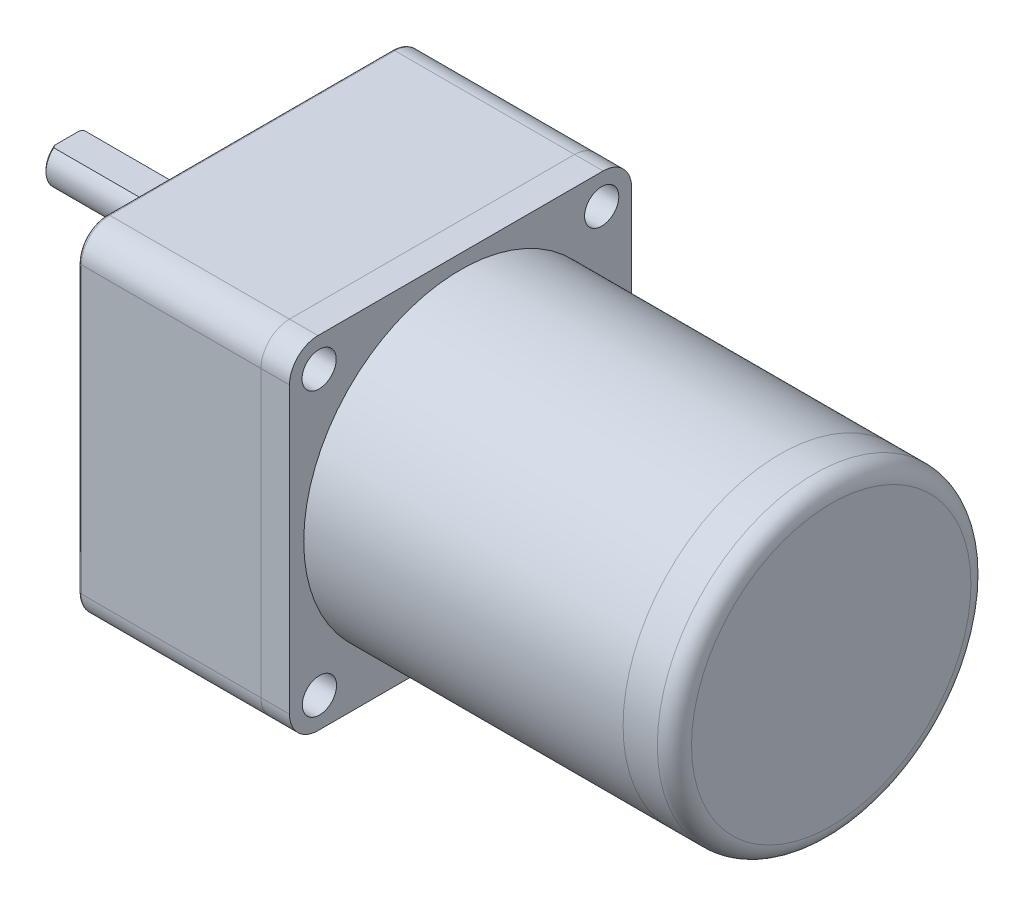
ISO-10303-21;
HEADER;
FILE_DESCRIPTION(('STEP AP214'),'2;1');
FILE_NAME('part.step','',(''),(''),'','','');
FILE_SCHEMA(('AUTOMOTIVE_DESIGN { 1 0 10303 214 1 1 1 1 }'));
ENDSEC;
DATA;
#1=APPLICATION_CONTEXT('core data for automotive mechanical design processes');
#2=APPLICATION_PROTOCOL_DEFINITION('international standard','automotive_design',2000,#1);
#3=PRODUCT_CONTEXT('',#1,'mechanical');
#4=PRODUCT('Part','Part','',(#3));
#5=PRODUCT_RELATED_PRODUCT_CATEGORY('part','',(#4));
#6=PRODUCT_DEFINITION_FORMATION('','',#4);
#7=PRODUCT_DEFINITION_CONTEXT('part definition',#1,'design');
#8=PRODUCT_DEFINITION('design','',#6,#7);
#9=PRODUCT_DEFINITION_SHAPE('','',#8);
#10=(LENGTH_UNIT() NAMED_UNIT(*) SI_UNIT(.MILLI.,.METRE.));
#11=(NAMED_UNIT(*) PLANE_ANGLE_UNIT() SI_UNIT($,.RADIAN.));
#12=(NAMED_UNIT(*) SI_UNIT($,.STERADIAN.) SOLID_ANGLE_UNIT());
#13=UNCERTAINTY_MEASURE_WITH_UNIT(LENGTH_MEASURE(1.E-05),#10,'distance_accuracy_value','');
#14=(GEOMETRIC_REPRESENTATION_CONTEXT(3) GLOBAL_UNCERTAINTY_ASSIGNED_CONTEXT((#13)) GLOBAL_UNIT_ASSIGNED_CONTEXT((#10,
#11,#12)) REPRESENTATION_CONTEXT('',''));
#15=CARTESIAN_POINT('',(0.,0.,0.));
#16=DIRECTION('',(0.,0.,1.));
#17=DIRECTION('',(1.,0.,0.));
#18=AXIS2_PLACEMENT_3D('',#15,#16,#17);
#19=CARTESIAN_POINT('',(-32.,10.,0.));
#20=DIRECTION('',(1.,0.,0.));
#21=DIRECTION('',(0.,0.,-1.));
#22=AXIS2_PLACEMENT_3D('',#19,#20,#21);
#23=CYLINDRICAL_SURFACE('',#22,4.);
#24=DIRECTION('',(-1.,0.,0.));
#25=VECTOR('',#24,1.);
#26=CARTESIAN_POINT('',(-7.,13.,2.64575131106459));
#27=LINE('',#26,#25);
#28=CARTESIAN_POINT('',(-7.,13.,2.64575131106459));
#29=VERTEX_POINT('',#28);
#30=CARTESIAN_POINT('',(-31.7,13.,2.64575131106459));
#31=VERTEX_POINT('',#30);
#32=EDGE_CURVE('E89',#29,#31,#27,.T.);
#33=ORIENTED_EDGE('',*,*,#32,.T.);
#34=CARTESIAN_POINT('',(-31.7,10.,0.));
#35=DIRECTION('',(-1.,0.,0.));
#36=DIRECTION('',(0.,0.,1.));
#37=AXIS2_PLACEMENT_3D('',#34,#35,#36);
#38=CIRCLE('',#37,4.);
#39=CARTESIAN_POINT('',(-31.7,13.,-2.64575131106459));
#40=VERTEX_POINT('',#39);
#41=EDGE_CURVE('E12',#31,#40,#38,.F.);
#42=ORIENTED_EDGE('',*,*,#41,.T.);
#43=DIRECTION('',(-1.,0.,0.));
#44=VECTOR('',#43,1.);
#45=CARTESIAN_POINT('',(-7.,13.,-2.64575131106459));
#46=LINE('',#45,#44);
#47=CARTESIAN_POINT('',(-7.,13.,-2.64575131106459));
#48=VERTEX_POINT('',#47);
#49=EDGE_CURVE('E87',#48,#40,#46,.T.);
#50=ORIENTED_EDGE('',*,*,#49,.F.);
#51=CARTESIAN_POINT('',(-7.,10.,0.));
#52=DIRECTION('',(-1.,0.,0.));
#53=DIRECTION('',(0.,0.,1.));
#54=AXIS2_PLACEMENT_3D('',#51,#52,#53);
#55=CIRCLE('',#54,4.);
#56=EDGE_CURVE('E80',#29,#48,#55,.T.);
#57=ORIENTED_EDGE('',*,*,#56,.F.);
#58=EDGE_LOOP('',(#33,#42,#50,#57));
#59=FACE_BOUND('',#58,.T.);
#60=CARTESIAN_POINT('',(-3.,10.,0.));
#61=DIRECTION('',(-1.,0.,0.));
#62=DIRECTION('',(0.,0.,1.));
#63=AXIS2_PLACEMENT_3D('',#60,#61,#62);
#64=CIRCLE('',#63,4.);
#65=CARTESIAN_POINT('',(-3.,10.,4.));
#66=VERTEX_POINT('',#65);
#67=EDGE_CURVE('E93',#66,#66,#64,.T.);
#68=ORIENTED_EDGE('',*,*,#67,.T.);
#69=EDGE_LOOP('',(#68));
#70=FACE_BOUND('',#69,.T.);
#71=ADVANCED_FACE('F46',(#59,#70),#23,.T.);
#72=CARTESIAN_POINT('',(-32.,10.,0.));
#73=DIRECTION('',(-1.,0.,0.));
#74=DIRECTION('',(0.,0.,1.));
#75=AXIS2_PLACEMENT_3D('',#72,#73,#74);
#76=PLANE('',#75);
#77=DIRECTION('',(0.,0.,1.));
#78=VECTOR('',#77,1.);
#79=CARTESIAN_POINT('',(-32.,13.,2.64575131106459));
#80=LINE('',#79,#78);
#81=CARTESIAN_POINT('',(-32.,13.,-2.16564078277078));
#82=VERTEX_POINT('',#81);
#83=CARTESIAN_POINT('',(-32.,13.,2.16564078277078));
#84=VERTEX_POINT('',#83);
#85=EDGE_CURVE('E84',#82,#84,#80,.T.);
#86=ORIENTED_EDGE('',*,*,#85,.F.);
#87=CARTESIAN_POINT('',(-32.,10.,0.));
#88=DIRECTION('',(-1.,0.,0.));
#89=DIRECTION('',(0.,0.,1.));
#90=AXIS2_PLACEMENT_3D('',#87,#88,#89);
#91=CIRCLE('',#90,3.70000000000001);
#92=EDGE_CURVE('E99',#82,#84,#91,.T.);
#93=ORIENTED_EDGE('',*,*,#92,.T.);
#94=EDGE_LOOP('',(#86,#93));
#95=FACE_BOUND('',#94,.T.);
#96=ADVANCED_FACE('F115',(#95),#76,.T.);
#97=CARTESIAN_POINT('',(-3.,10.,0.));
#98=DIRECTION('',(-1.,0.,0.));
#99=DIRECTION('',(0.,0.,1.));
#100=AXIS2_PLACEMENT_3D('',#97,#98,#99);
#101=PLANE('',#100);
#102=ORIENTED_EDGE('',*,*,#67,.F.);
#103=EDGE_LOOP('',(#102));
#104=FACE_BOUND('',#103,.T.);
#105=ADVANCED_FACE('F114',(#104),#101,.F.);
#106=CARTESIAN_POINT('',(-7.,13.,2.64575131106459));
#107=DIRECTION('',(0.,-1.,0.));
#108=DIRECTION('',(0.,0.,-1.));
#109=AXIS2_PLACEMENT_3D('',#106,#107,#108);
#110=PLANE('',#109);
#111=ORIENTED_EDGE('',*,*,#85,.T.);
#112=CARTESIAN_POINT('',(-32.,13.,2.16564078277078));
#113=CARTESIAN_POINT('',(-31.9761619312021,13.,2.20636622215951));
#114=CARTESIAN_POINT('',(-31.95199678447,13.,2.2468991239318));
#115=CARTESIAN_POINT('',(-31.9030718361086,13.,2.32759423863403));
#116=CARTESIAN_POINT('',(-31.8783121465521,13.,2.36775651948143));
#117=CARTESIAN_POINT('',(-31.8282492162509,13.,2.44773910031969));
#118=CARTESIAN_POINT('',(-31.80294598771,13.,2.48755940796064));
#119=CARTESIAN_POINT('',(-31.7518371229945,13.,2.56688695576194));
#120=CARTESIAN_POINT('',(-31.7260313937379,13.,2.60639413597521));
#121=CARTESIAN_POINT('',(-31.7000000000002,13.,2.64575131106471));
#122=B_SPLINE_CURVE_WITH_KNOTS('',3,(#112,#113,#114,#115,#116,#117,#118,#119,#120,#121),
.UNSPECIFIED.,.F.,.F.,(4,2,2,2,4),(0.,0.141564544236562,0.28310260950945,0.424637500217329,
0.566198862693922),.UNSPECIFIED.);
#123=EDGE_CURVE('E55',#84,#31,#122,.T.);
#124=ORIENTED_EDGE('',*,*,#123,.T.);
#125=ORIENTED_EDGE('',*,*,#32,.F.);
#126=DIRECTION('',(0.,0.,1.));
#127=VECTOR('',#126,1.);
#128=CARTESIAN_POINT('',(-7.,13.,2.64575131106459));
#129=LINE('',#128,#127);
#130=EDGE_CURVE('E83',#48,#29,#129,.T.);
#131=ORIENTED_EDGE('',*,*,#130,.F.);
#132=ORIENTED_EDGE('',*,*,#49,.T.);
#133=CARTESIAN_POINT('',(-31.7,13.,-2.64575131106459));
#134=CARTESIAN_POINT('',(-31.7260313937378,13.,-2.60639413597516));
#135=CARTESIAN_POINT('',(-31.7518371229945,13.,-2.56688695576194));
#136=CARTESIAN_POINT('',(-31.80294598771,13.,-2.48755940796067));
#137=CARTESIAN_POINT('',(-31.8282492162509,13.,-2.44773910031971));
#138=CARTESIAN_POINT('',(-31.878312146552,13.,-2.36775651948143));
#139=CARTESIAN_POINT('',(-31.9030718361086,13.,-2.32759423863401));
#140=CARTESIAN_POINT('',(-31.9519967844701,13.,-2.24689912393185));
#141=CARTESIAN_POINT('',(-31.9761619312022,13.,-2.20636622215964));
#142=CARTESIAN_POINT('',(-32.0000000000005,13.,-2.16564078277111));
#143=B_SPLINE_CURVE_WITH_KNOTS('',3,(#133,#134,#135,#136,#137,#138,#139,#140,#141,#142),
.UNSPECIFIED.,.F.,.F.,(4,2,2,2,4),(0.,0.141561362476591,0.283096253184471,0.424634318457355,
0.566198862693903),.UNSPECIFIED.);
#144=EDGE_CURVE('E102',#40,#82,#143,.T.);
#145=ORIENTED_EDGE('',*,*,#144,.T.);
#146=EDGE_LOOP('',(#111,#124,#125,#131,#132,#145));
#147=FACE_BOUND('',#146,.T.);
#148=ADVANCED_FACE('F86',(#147),#110,.F.);
#149=CARTESIAN_POINT('',(-7.,10.,0.));
#150=DIRECTION('',(-1.,0.,0.));
#151=DIRECTION('',(0.,0.,1.));
#152=AXIS2_PLACEMENT_3D('',#149,#150,#151);
#153=PLANE('',#152);
#154=ORIENTED_EDGE('',*,*,#56,.T.);
#155=ORIENTED_EDGE('',*,*,#130,.T.);
#156=EDGE_LOOP('',(#154,#155));
#157=FACE_BOUND('',#156,.T.);
#158=ADVANCED_FACE('F82',(#157),#153,.T.);
#159=CARTESIAN_POINT('',(-32.,10.,0.));
#160=DIRECTION('',(1.,0.,0.));
#161=DIRECTION('',(0.,0.,-1.));
#162=AXIS2_PLACEMENT_3D('',#159,#160,#161);
#163=CONICAL_SURFACE('',#162,3.70000000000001,0.785398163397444);
#164=ORIENTED_EDGE('',*,*,#144,.F.);
#165=ORIENTED_EDGE('',*,*,#41,.F.);
#166=ORIENTED_EDGE('',*,*,#123,.F.);
#167=ORIENTED_EDGE('',*,*,#92,.F.);
#168=EDGE_LOOP('',(#164,#165,#166,#167));
#169=FACE_BOUND('',#168,.T.);
#170=ADVANCED_FACE('F48',(#169),#163,.T.);
#171=CLOSED_SHELL('',(#71,#96,#105,#148,#158,#170));
#172=MANIFOLD_SOLID_BREP('B2',#171);
#173=CARTESIAN_POINT('',(-3.,10.,0.));
#174=DIRECTION('',(1.,0.,0.));
#175=DIRECTION('',(0.,0.,-1.));
#176=AXIS2_PLACEMENT_3D('',#173,#174,#175);
#177=CYLINDRICAL_SURFACE('',#176,12.);
#178=CARTESIAN_POINT('',(-2.5,10.,0.));
#179=DIRECTION('',(-1.,0.,0.));
#180=DIRECTION('',(0.,0.,1.));
#181=AXIS2_PLACEMENT_3D('',#178,#179,#180);
#182=CIRCLE('',#181,12.);
#183=CARTESIAN_POINT('',(-2.5,10.,12.));
#184=VERTEX_POINT('',#183);
#185=EDGE_CURVE('E45',#184,#184,#182,.F.);
#186=ORIENTED_EDGE('',*,*,#185,.T.);
#187=EDGE_LOOP('',(#186));
#188=FACE_BOUND('',#187,.T.);
#189=CARTESIAN_POINT('',(0.,10.,0.));
#190=DIRECTION('',(-1.,0.,0.));
#191=DIRECTION('',(0.,0.,1.));
#192=AXIS2_PLACEMENT_3D('',#189,#190,#191);
#193=CIRCLE('',#192,12.);
#194=CARTESIAN_POINT('',(0.,10.,12.));
#195=VERTEX_POINT('',#194);
#196=EDGE_CURVE('E188',#195,#195,#193,.T.);
#197=ORIENTED_EDGE('',*,*,#196,.T.);
#198=EDGE_LOOP('',(#197));
#199=FACE_BOUND('',#198,.T.);
#200=ADVANCED_FACE('F177',(#188,#199),#177,.T.);
#201=CARTESIAN_POINT('',(-3.,10.,0.));
#202=DIRECTION('',(-1.,0.,0.));
#203=DIRECTION('',(0.,0.,1.));
#204=AXIS2_PLACEMENT_3D('',#201,#202,#203);
#205=PLANE('',#204);
#206=CARTESIAN_POINT('',(-3.,10.,0.));
#207=DIRECTION('',(-1.,0.,0.));
#208=DIRECTION('',(0.,0.,1.));
#209=AXIS2_PLACEMENT_3D('',#206,#207,#208);
#210=CIRCLE('',#209,11.5);
#211=CARTESIAN_POINT('',(-3.,10.,11.5));
#212=VERTEX_POINT('',#211);
#213=EDGE_CURVE('E184',#212,#212,#210,.T.);
#214=ORIENTED_EDGE('',*,*,#213,.T.);
#215=EDGE_LOOP('',(#214));
#216=FACE_BOUND('',#215,.T.);
#217=ADVANCED_FACE('F198',(#216),#205,.T.);
#218=CARTESIAN_POINT('',(0.,10.,0.));
#219=DIRECTION('',(-1.,0.,0.));
#220=DIRECTION('',(0.,0.,1.));
#221=AXIS2_PLACEMENT_3D('',#218,#219,#220);
#222=PLANE('',#221);
#223=ORIENTED_EDGE('',*,*,#196,.F.);
#224=EDGE_LOOP('',(#223));
#225=FACE_BOUND('',#224,.T.);
#226=ADVANCED_FACE('F196',(#225),#222,.F.);
#227=CARTESIAN_POINT('',(-2.5,10.,0.));
#228=DIRECTION('',(-1.,0.,0.));
#229=DIRECTION('',(0.,0.,1.));
#230=AXIS2_PLACEMENT_3D('',#227,#228,#229);
#231=TOROIDAL_SURFACE('',#230,11.5,0.5);
#232=ORIENTED_EDGE('',*,*,#185,.F.);
#233=EDGE_LOOP('',(#232));
#234=FACE_BOUND('',#233,.T.);
#235=ORIENTED_EDGE('',*,*,#213,.F.);
#236=EDGE_LOOP('',(#235));
#237=FACE_BOUND('',#236,.T.);
#238=ADVANCED_FACE('F179',(#234,#237),#231,.T.);
#239=CLOSED_SHELL('',(#200,#217,#226,#238));
#240=MANIFOLD_SOLID_BREP('B6',#239);
#241=CARTESIAN_POINT('',(102.,0.,0.));
#242=DIRECTION('',(-1.,0.,0.));
#243=DIRECTION('',(0.,0.,1.));
#244=AXIS2_PLACEMENT_3D('',#241,#242,#243);
#245=CYLINDRICAL_SURFACE('',#244,27.5);
#246=CARTESIAN_POINT('',(99.,0.,0.));
#247=DIRECTION('',(1.,0.,0.));
#248=DIRECTION('',(0.,0.,-1.));
#249=AXIS2_PLACEMENT_3D('',#246,#247,#248);
#250=CIRCLE('',#249,27.5);
#251=CARTESIAN_POINT('',(99.,0.,-27.5));
#252=VERTEX_POINT('',#251);
#253=EDGE_CURVE('E176',#252,#252,#250,.F.);
#254=ORIENTED_EDGE('',*,*,#253,.T.);
#255=EDGE_LOOP('',(#254));
#256=FACE_BOUND('',#255,.T.);
#257=CARTESIAN_POINT('',(93.,0.,0.));
#258=DIRECTION('',(1.,0.,0.));
#259=DIRECTION('',(0.,0.,-1.));
#260=AXIS2_PLACEMENT_3D('',#257,#258,#259);
#261=CIRCLE('',#260,27.5);
#262=CARTESIAN_POINT('',(93.,0.,-27.5));
#263=VERTEX_POINT('',#262);
#264=EDGE_CURVE('E252',#263,#263,#261,.T.);
#265=ORIENTED_EDGE('',*,*,#264,.T.);
#266=EDGE_LOOP('',(#265));
#267=FACE_BOUND('',#266,.T.);
#268=ADVANCED_FACE('F241',(#256,#267),#245,.T.);
#269=CARTESIAN_POINT('',(102.,0.,0.));
#270=DIRECTION('',(1.,0.,0.));
#271=DIRECTION('',(0.,0.,-1.));
#272=AXIS2_PLACEMENT_3D('',#269,#270,#271);
#273=PLANE('',#272);
#274=CARTESIAN_POINT('',(102.,0.,0.));
#275=DIRECTION('',(1.,0.,0.));
#276=DIRECTION('',(0.,0.,-1.));
#277=AXIS2_PLACEMENT_3D('',#274,#275,#276);
#278=CIRCLE('',#277,24.5);
#279=CARTESIAN_POINT('',(102.,0.,-24.5));
#280=VERTEX_POINT('',#279);
#281=EDGE_CURVE('E248',#280,#280,#278,.T.);
#282=ORIENTED_EDGE('',*,*,#281,.T.);
#283=EDGE_LOOP('',(#282));
#284=FACE_BOUND('',#283,.T.);
#285=ADVANCED_FACE('F262',(#284),#273,.T.);
#286=CARTESIAN_POINT('',(93.,0.,0.));
#287=DIRECTION('',(1.,0.,0.));
#288=DIRECTION('',(0.,0.,-1.));
#289=AXIS2_PLACEMENT_3D('',#286,#287,#288);
#290=PLANE('',#289);
#291=ORIENTED_EDGE('',*,*,#264,.F.);
#292=EDGE_LOOP('',(#291));
#293=FACE_BOUND('',#292,.T.);
#294=ADVANCED_FACE('F260',(#293),#290,.F.);
#295=CARTESIAN_POINT('',(99.,0.,0.));
#296=DIRECTION('',(1.,0.,0.));
#297=DIRECTION('',(0.,0.,-1.));
#298=AXIS2_PLACEMENT_3D('',#295,#296,#297);
#299=TOROIDAL_SURFACE('',#298,24.5,3.);
#300=ORIENTED_EDGE('',*,*,#253,.F.);
#301=EDGE_LOOP('',(#300));
#302=FACE_BOUND('',#301,.T.);
#303=ORIENTED_EDGE('',*,*,#281,.F.);
#304=EDGE_LOOP('',(#303));
#305=FACE_BOUND('',#304,.T.);
#306=ADVANCED_FACE('F243',(#302,#305),#299,.T.);
#307=CLOSED_SHELL('',(#268,#285,#294,#306));
#308=MANIFOLD_SOLID_BREP('B40',#307);
#309=CARTESIAN_POINT('',(93.,0.,0.));
#310=DIRECTION('',(-1.,0.,0.));
#311=DIRECTION('',(0.,0.,1.));
#312=AXIS2_PLACEMENT_3D('',#309,#310,#311);
#313=CYLINDRICAL_SURFACE('',#312,27.5);
#314=CARTESIAN_POINT('',(93.,0.,0.));
#315=DIRECTION('',(1.,0.,0.));
#316=DIRECTION('',(0.,0.,-1.));
#317=AXIS2_PLACEMENT_3D('',#314,#315,#316);
#318=CIRCLE('',#317,27.5);
#319=CARTESIAN_POINT('',(93.,0.,-27.5));
#320=VERTEX_POINT('',#319);
#321=EDGE_CURVE('E240',#320,#320,#318,.T.);
#322=ORIENTED_EDGE('',*,*,#321,.F.);
#323=EDGE_LOOP('',(#322));
#324=FACE_BOUND('',#323,.T.);
#325=CARTESIAN_POINT('',(37.,0.,0.));
#326=DIRECTION('',(1.,0.,0.));
#327=DIRECTION('',(0.,0.,-1.));
#328=AXIS2_PLACEMENT_3D('',#325,#326,#327);
#329=CIRCLE('',#328,27.5);
#330=CARTESIAN_POINT('',(37.,0.,-27.5));
#331=VERTEX_POINT('',#330);
#332=EDGE_CURVE('E310',#331,#331,#329,.T.);
#333=ORIENTED_EDGE('',*,*,#332,.T.);
#334=EDGE_LOOP('',(#333));
#335=FACE_BOUND('',#334,.T.);
#336=ADVANCED_FACE('F307',(#324,#335),#313,.T.);
#337=CARTESIAN_POINT('',(93.,0.,0.));
#338=DIRECTION('',(1.,0.,0.));
#339=DIRECTION('',(0.,0.,-1.));
#340=AXIS2_PLACEMENT_3D('',#337,#338,#339);
#341=PLANE('',#340);
#342=ORIENTED_EDGE('',*,*,#321,.T.);
#343=EDGE_LOOP('',(#342));
#344=FACE_BOUND('',#343,.T.);
#345=ADVANCED_FACE('F322',(#344),#341,.T.);
#346=CARTESIAN_POINT('',(37.,0.,0.));
#347=DIRECTION('',(1.,0.,0.));
#348=DIRECTION('',(0.,0.,-1.));
#349=AXIS2_PLACEMENT_3D('',#346,#347,#348);
#350=PLANE('',#349);
#351=ORIENTED_EDGE('',*,*,#332,.F.);
#352=EDGE_LOOP('',(#351));
#353=FACE_BOUND('',#352,.T.);
#354=ADVANCED_FACE('F320',(#353),#350,.F.);
#355=CLOSED_SHELL('',(#336,#345,#354));
#356=MANIFOLD_SOLID_BREP('B171',#355);
#357=CARTESIAN_POINT('',(37.,25.,-25.));
#358=DIRECTION('',(-1.,0.,0.));
#359=DIRECTION('',(0.,0.,1.));
#360=AXIS2_PLACEMENT_3D('',#357,#358,#359);
#361=CYLINDRICAL_SURFACE('',#360,5.);
#362=CARTESIAN_POINT('',(32.,25.,-25.));
#363=DIRECTION('',(1.,0.,0.));
#364=DIRECTION('',(0.,0.,1.));
#365=AXIS2_PLACEMENT_3D('',#362,#363,#364);
#366=CIRCLE('',#365,5.);
#367=CARTESIAN_POINT('',(32.,25.,-30.));
#368=VERTEX_POINT('',#367);
#369=CARTESIAN_POINT('',(32.,30.,-25.));
#370=VERTEX_POINT('',#369);
#371=EDGE_CURVE('E455',#368,#370,#366,.T.);
#372=ORIENTED_EDGE('',*,*,#371,.T.);
#373=DIRECTION('',(-1.,0.,0.));
#374=VECTOR('',#373,1.);
#375=CARTESIAN_POINT('',(37.,30.,-25.));
#376=LINE('',#375,#374);
#377=CARTESIAN_POINT('',(37.,30.,-25.));
#378=VERTEX_POINT('',#377);
#379=EDGE_CURVE('E305',#378,#370,#376,.T.);
#380=ORIENTED_EDGE('',*,*,#379,.F.);
#381=CARTESIAN_POINT('',(37.,25.,-25.));
#382=DIRECTION('',(1.,0.,0.));
#383=DIRECTION('',(0.,0.,1.));
#384=AXIS2_PLACEMENT_3D('',#381,#382,#383);
#385=CIRCLE('',#384,5.);
#386=CARTESIAN_POINT('',(37.,25.,-30.));
#387=VERTEX_POINT('',#386);
#388=EDGE_CURVE('E469',#387,#378,#385,.T.);
#389=ORIENTED_EDGE('',*,*,#388,.F.);
#390=DIRECTION('',(-1.,0.,0.));
#391=VECTOR('',#390,1.);
#392=CARTESIAN_POINT('',(37.,25.,-30.));
#393=LINE('',#392,#391);
#394=EDGE_CURVE('E451',#387,#368,#393,.T.);
#395=ORIENTED_EDGE('',*,*,#394,.T.);
#396=EDGE_LOOP('',(#372,#380,#389,#395));
#397=FACE_BOUND('',#396,.T.);
#398=ADVANCED_FACE('F357',(#397),#361,.T.);
#399=CARTESIAN_POINT('',(37.,30.,25.));
#400=DIRECTION('',(0.,-1.,0.));
#401=DIRECTION('',(0.,0.,-1.));
#402=AXIS2_PLACEMENT_3D('',#399,#400,#401);
#403=PLANE('',#402);
#404=DIRECTION('',(0.,0.,1.));
#405=VECTOR('',#404,1.);
#406=CARTESIAN_POINT('',(32.,30.,25.));
#407=LINE('',#406,#405);
#408=CARTESIAN_POINT('',(32.,30.,25.));
#409=VERTEX_POINT('',#408);
#410=EDGE_CURVE('E458',#370,#409,#407,.T.);
#411=ORIENTED_EDGE('',*,*,#410,.T.);
#412=DIRECTION('',(-1.,0.,0.));
#413=VECTOR('',#412,1.);
#414=CARTESIAN_POINT('',(37.,30.,25.));
#415=LINE('',#414,#413);
#416=CARTESIAN_POINT('',(37.,30.,25.));
#417=VERTEX_POINT('',#416);
#418=EDGE_CURVE('E366',#417,#409,#415,.T.);
#419=ORIENTED_EDGE('',*,*,#418,.F.);
#420=DIRECTION('',(0.,0.,1.));
#421=VECTOR('',#420,1.);
#422=CARTESIAN_POINT('',(37.,30.,25.));
#423=LINE('',#422,#421);
#424=EDGE_CURVE('E418',#378,#417,#423,.T.);
#425=ORIENTED_EDGE('',*,*,#424,.F.);
#426=ORIENTED_EDGE('',*,*,#379,.T.);
#427=EDGE_LOOP('',(#411,#419,#425,#426));
#428=FACE_BOUND('',#427,.T.);
#429=ADVANCED_FACE('F523',(#428),#403,.F.);
#430=CARTESIAN_POINT('',(37.,25.,25.));
#431=DIRECTION('',(-1.,0.,0.));
#432=DIRECTION('',(0.,0.,1.));
#433=AXIS2_PLACEMENT_3D('',#430,#431,#432);
#434=CYLINDRICAL_SURFACE('',#433,5.);
#435=CARTESIAN_POINT('',(32.,25.,25.));
#436=DIRECTION('',(1.,0.,0.));
#437=DIRECTION('',(0.,0.,1.));
#438=AXIS2_PLACEMENT_3D('',#435,#436,#437);
#439=CIRCLE('',#438,5.);
#440=CARTESIAN_POINT('',(32.,25.,30.));
#441=VERTEX_POINT('',#440);
#442=EDGE_CURVE('E460',#409,#441,#439,.T.);
#443=ORIENTED_EDGE('',*,*,#442,.T.);
#444=DIRECTION('',(-1.,0.,0.));
#445=VECTOR('',#444,1.);
#446=CARTESIAN_POINT('',(37.,25.,30.));
#447=LINE('',#446,#445);
#448=CARTESIAN_POINT('',(37.,25.,30.));
#449=VERTEX_POINT('',#448);
#450=EDGE_CURVE('E476',#449,#441,#447,.T.);
#451=ORIENTED_EDGE('',*,*,#450,.F.);
#452=CARTESIAN_POINT('',(37.,25.,25.));
#453=DIRECTION('',(1.,0.,0.));
#454=DIRECTION('',(0.,0.,1.));
#455=AXIS2_PLACEMENT_3D('',#452,#453,#454);
#456=CIRCLE('',#455,5.);
#457=EDGE_CURVE('E624',#417,#449,#456,.T.);
#458=ORIENTED_EDGE('',*,*,#457,.F.);
#459=ORIENTED_EDGE('',*,*,#418,.T.);
#460=EDGE_LOOP('',(#443,#451,#458,#459));
#461=FACE_BOUND('',#460,.T.);
#462=ADVANCED_FACE('F527',(#461),#434,.T.);
#463=CARTESIAN_POINT('',(37.,-25.,30.));
#464=DIRECTION('',(0.,0.,-1.));
#465=DIRECTION('',(-1.,0.,0.));
#466=AXIS2_PLACEMENT_3D('',#463,#464,#465);
#467=PLANE('',#466);
#468=DIRECTION('',(0.,-1.,0.));
#469=VECTOR('',#468,1.);
#470=CARTESIAN_POINT('',(32.,-25.,30.));
#471=LINE('',#470,#469);
#472=CARTESIAN_POINT('',(32.,-25.,30.));
#473=VERTEX_POINT('',#472);
#474=EDGE_CURVE('E462',#441,#473,#471,.T.);
#475=ORIENTED_EDGE('',*,*,#474,.T.);
#476=DIRECTION('',(-1.,0.,0.));
#477=VECTOR('',#476,1.);
#478=CARTESIAN_POINT('',(37.,-25.,30.));
#479=LINE('',#478,#477);
#480=CARTESIAN_POINT('',(37.,-25.,30.));
#481=VERTEX_POINT('',#480);
#482=EDGE_CURVE('E473',#481,#473,#479,.T.);
#483=ORIENTED_EDGE('',*,*,#482,.F.);
#484=DIRECTION('',(0.,-1.,0.));
#485=VECTOR('',#484,1.);
#486=CARTESIAN_POINT('',(37.,-25.,30.));
#487=LINE('',#486,#485);
#488=EDGE_CURVE('E626',#449,#481,#487,.T.);
#489=ORIENTED_EDGE('',*,*,#488,.F.);
#490=ORIENTED_EDGE('',*,*,#450,.T.);
#491=EDGE_LOOP('',(#475,#483,#489,#490));
#492=FACE_BOUND('',#491,.T.);
#493=ADVANCED_FACE('F531',(#492),#467,.F.);
#494=CARTESIAN_POINT('',(37.,-25.,25.));
#495=DIRECTION('',(-1.,0.,0.));
#496=DIRECTION('',(0.,0.,1.));
#497=AXIS2_PLACEMENT_3D('',#494,#495,#496);
#498=CYLINDRICAL_SURFACE('',#497,5.);
#499=CARTESIAN_POINT('',(32.,-25.,25.));
#500=DIRECTION('',(1.,0.,0.));
#501=DIRECTION('',(0.,0.,1.));
#502=AXIS2_PLACEMENT_3D('',#499,#500,#501);
#503=CIRCLE('',#502,5.);
#504=CARTESIAN_POINT('',(32.,-30.,25.));
#505=VERTEX_POINT('',#504);
#506=EDGE_CURVE('E464',#473,#505,#503,.T.);
#507=ORIENTED_EDGE('',*,*,#506,.T.);
#508=DIRECTION('',(-1.,0.,0.));
#509=VECTOR('',#508,1.);
#510=CARTESIAN_POINT('',(37.,-30.,25.));
#511=LINE('',#510,#509);
#512=CARTESIAN_POINT('',(37.,-30.,25.));
#513=VERTEX_POINT('',#512);
#514=EDGE_CURVE('E446',#513,#505,#511,.T.);
#515=ORIENTED_EDGE('',*,*,#514,.F.);
#516=CARTESIAN_POINT('',(37.,-25.,25.));
#517=DIRECTION('',(1.,0.,0.));
#518=DIRECTION('',(0.,0.,1.));
#519=AXIS2_PLACEMENT_3D('',#516,#517,#518);
#520=CIRCLE('',#519,5.);
#521=EDGE_CURVE('E437',#481,#513,#520,.T.);
#522=ORIENTED_EDGE('',*,*,#521,.F.);
#523=ORIENTED_EDGE('',*,*,#482,.T.);
#524=EDGE_LOOP('',(#507,#515,#522,#523));
#525=FACE_BOUND('',#524,.T.);
#526=ADVANCED_FACE('F537',(#525),#498,.T.);
#527=CARTESIAN_POINT('',(37.,-30.,25.));
#528=DIRECTION('',(0.,1.,0.));
#529=DIRECTION('',(0.,0.,1.));
#530=AXIS2_PLACEMENT_3D('',#527,#528,#529);
#531=PLANE('',#530);
#532=DIRECTION('',(0.,0.,-1.));
#533=VECTOR('',#532,1.);
#534=CARTESIAN_POINT('',(32.,-30.,25.));
#535=LINE('',#534,#533);
#536=CARTESIAN_POINT('',(32.,-30.,-25.));
#537=VERTEX_POINT('',#536);
#538=EDGE_CURVE('E445',#505,#537,#535,.T.);
#539=ORIENTED_EDGE('',*,*,#538,.T.);
#540=DIRECTION('',(-1.,0.,0.));
#541=VECTOR('',#540,1.);
#542=CARTESIAN_POINT('',(37.,-30.,-25.));
#543=LINE('',#542,#541);
#544=CARTESIAN_POINT('',(37.,-30.,-25.));
#545=VERTEX_POINT('',#544);
#546=EDGE_CURVE('E442',#545,#537,#543,.T.);
#547=ORIENTED_EDGE('',*,*,#546,.F.);
#548=DIRECTION('',(0.,0.,-1.));
#549=VECTOR('',#548,1.);
#550=CARTESIAN_POINT('',(37.,-30.,25.));
#551=LINE('',#550,#549);
#552=EDGE_CURVE('E431',#513,#545,#551,.T.);
#553=ORIENTED_EDGE('',*,*,#552,.F.);
#554=ORIENTED_EDGE('',*,*,#514,.T.);
#555=EDGE_LOOP('',(#539,#547,#553,#554));
#556=FACE_BOUND('',#555,.T.);
#557=ADVANCED_FACE('F443',(#556),#531,.F.);
#558=CARTESIAN_POINT('',(37.,-25.,-25.));
#559=DIRECTION('',(-1.,0.,0.));
#560=DIRECTION('',(0.,0.,1.));
#561=AXIS2_PLACEMENT_3D('',#558,#559,#560);
#562=CYLINDRICAL_SURFACE('',#561,5.);
#563=CARTESIAN_POINT('',(32.,-25.,-25.));
#564=DIRECTION('',(1.,0.,0.));
#565=DIRECTION('',(0.,0.,-1.));
#566=AXIS2_PLACEMENT_3D('',#563,#564,#565);
#567=CIRCLE('',#566,5.);
#568=CARTESIAN_POINT('',(32.,-25.,-30.));
#569=VERTEX_POINT('',#568);
#570=EDGE_CURVE('E404',#537,#569,#567,.T.);
#571=ORIENTED_EDGE('',*,*,#570,.T.);
#572=DIRECTION('',(-1.,0.,0.));
#573=VECTOR('',#572,1.);
#574=CARTESIAN_POINT('',(37.,-25.,-30.));
#575=LINE('',#574,#573);
#576=CARTESIAN_POINT('',(37.,-25.,-30.));
#577=VERTEX_POINT('',#576);
#578=EDGE_CURVE('E447',#577,#569,#575,.T.);
#579=ORIENTED_EDGE('',*,*,#578,.F.);
#580=CARTESIAN_POINT('',(37.,-25.,-25.));
#581=DIRECTION('',(1.,0.,0.));
#582=DIRECTION('',(0.,0.,-1.));
#583=AXIS2_PLACEMENT_3D('',#580,#581,#582);
#584=CIRCLE('',#583,5.);
#585=EDGE_CURVE('E435',#545,#577,#584,.T.);
#586=ORIENTED_EDGE('',*,*,#585,.F.);
#587=ORIENTED_EDGE('',*,*,#546,.T.);
#588=EDGE_LOOP('',(#571,#579,#586,#587));
#589=FACE_BOUND('',#588,.T.);
#590=ADVANCED_FACE('F449',(#589),#562,.T.);
#591=CARTESIAN_POINT('',(37.,-25.,-30.));
#592=DIRECTION('',(0.,0.,1.));
#593=DIRECTION('',(1.,0.,0.));
#594=AXIS2_PLACEMENT_3D('',#591,#592,#593);
#595=PLANE('',#594);
#596=DIRECTION('',(0.,1.,0.));
#597=VECTOR('',#596,1.);
#598=CARTESIAN_POINT('',(32.,-25.,-30.));
#599=LINE('',#598,#597);
#600=EDGE_CURVE('E410',#569,#368,#599,.T.);
#601=ORIENTED_EDGE('',*,*,#600,.T.);
#602=ORIENTED_EDGE('',*,*,#394,.F.);
#603=DIRECTION('',(0.,1.,0.));
#604=VECTOR('',#603,1.);
#605=CARTESIAN_POINT('',(37.,-25.,-30.));
#606=LINE('',#605,#604);
#607=EDGE_CURVE('E375',#577,#387,#606,.T.);
#608=ORIENTED_EDGE('',*,*,#607,.F.);
#609=ORIENTED_EDGE('',*,*,#578,.T.);
#610=EDGE_LOOP('',(#601,#602,#608,#609));
#611=FACE_BOUND('',#610,.T.);
#612=ADVANCED_FACE('F512',(#611),#595,.F.);
#613=CARTESIAN_POINT('',(37.,25.,-25.));
#614=DIRECTION('',(-1.,0.,0.));
#615=DIRECTION('',(0.,0.,1.));
#616=AXIS2_PLACEMENT_3D('',#613,#614,#615);
#617=PLANE('',#616);
#618=CARTESIAN_POINT('',(37.,24.8007290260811,24.8007290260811));
#619=DIRECTION('',(1.,0.,0.));
#620=DIRECTION('',(0.,0.,-1.));
#621=AXIS2_PLACEMENT_3D('',#618,#619,#620);
#622=CIRCLE('',#621,3.);
#623=CARTESIAN_POINT('',(37.,24.8007290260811,21.8007290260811));
#624=VERTEX_POINT('',#623);
#625=EDGE_CURVE('E485',#624,#624,#622,.T.);
#626=ORIENTED_EDGE('',*,*,#625,.F.);
#627=EDGE_LOOP('',(#626));
#628=FACE_BOUND('',#627,.T.);
#629=CARTESIAN_POINT('',(37.,24.7487373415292,-24.7487373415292));
#630=DIRECTION('',(1.,0.,0.));
#631=DIRECTION('',(0.,0.,-1.));
#632=AXIS2_PLACEMENT_3D('',#629,#630,#631);
#633=CIRCLE('',#632,3.);
#634=CARTESIAN_POINT('',(37.,24.7487373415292,-27.7487373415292));
#635=VERTEX_POINT('',#634);
#636=EDGE_CURVE('E610',#635,#635,#633,.T.);
#637=ORIENTED_EDGE('',*,*,#636,.F.);
#638=EDGE_LOOP('',(#637));
#639=FACE_BOUND('',#638,.T.);
#640=CARTESIAN_POINT('',(37.,-24.7487373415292,-24.7487373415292));
#641=DIRECTION('',(1.,0.,0.));
#642=DIRECTION('',(0.,0.,-1.));
#643=AXIS2_PLACEMENT_3D('',#640,#641,#642);
#644=CIRCLE('',#643,3.);
#645=CARTESIAN_POINT('',(37.,-24.7487373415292,-27.7487373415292));
#646=VERTEX_POINT('',#645);
#647=EDGE_CURVE('E612',#646,#646,#644,.T.);
#648=ORIENTED_EDGE('',*,*,#647,.F.);
#649=EDGE_LOOP('',(#648));
#650=FACE_BOUND('',#649,.T.);
#651=CARTESIAN_POINT('',(37.,-24.7487373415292,24.7487373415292));
#652=DIRECTION('',(1.,0.,0.));
#653=DIRECTION('',(0.,0.,-1.));
#654=AXIS2_PLACEMENT_3D('',#651,#652,#653);
#655=CIRCLE('',#654,3.);
#656=CARTESIAN_POINT('',(37.,-24.7487373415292,21.7487373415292));
#657=VERTEX_POINT('',#656);
#658=EDGE_CURVE('E617',#657,#657,#655,.T.);
#659=ORIENTED_EDGE('',*,*,#658,.F.);
#660=EDGE_LOOP('',(#659));
#661=FACE_BOUND('',#660,.T.);
#662=ORIENTED_EDGE('',*,*,#388,.T.);
#663=ORIENTED_EDGE('',*,*,#424,.T.);
#664=ORIENTED_EDGE('',*,*,#457,.T.);
#665=ORIENTED_EDGE('',*,*,#488,.T.);
#666=ORIENTED_EDGE('',*,*,#521,.T.);
#667=ORIENTED_EDGE('',*,*,#552,.T.);
#668=ORIENTED_EDGE('',*,*,#585,.T.);
#669=ORIENTED_EDGE('',*,*,#607,.T.);
#670=EDGE_LOOP('',(#662,#663,#664,#665,#666,#667,#668,#669));
#671=FACE_BOUND('',#670,.T.);
#672=ADVANCED_FACE('F433',(#628,#639,#650,#661,#671),#617,.F.);
#673=CARTESIAN_POINT('',(32.,25.,-25.));
#674=DIRECTION('',(-1.,0.,0.));
#675=DIRECTION('',(0.,0.,1.));
#676=AXIS2_PLACEMENT_3D('',#673,#674,#675);
#677=PLANE('',#676);
#678=CARTESIAN_POINT('',(32.,24.8007290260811,24.8007290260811));
#679=DIRECTION('',(-1.,0.,0.));
#680=DIRECTION('',(0.,0.,1.));
#681=AXIS2_PLACEMENT_3D('',#678,#679,#680);
#682=CIRCLE('',#681,3.);
#683=CARTESIAN_POINT('',(32.,24.8007290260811,27.8007290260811));
#684=VERTEX_POINT('',#683);
#685=EDGE_CURVE('E360',#684,#684,#682,.T.);
#686=ORIENTED_EDGE('',*,*,#685,.F.);
#687=EDGE_LOOP('',(#686));
#688=FACE_BOUND('',#687,.T.);
#689=CARTESIAN_POINT('',(32.,24.7487373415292,-24.7487373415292));
#690=DIRECTION('',(-1.,0.,0.));
#691=DIRECTION('',(0.,0.,1.));
#692=AXIS2_PLACEMENT_3D('',#689,#690,#691);
#693=CIRCLE('',#692,3.);
#694=CARTESIAN_POINT('',(32.,24.7487373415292,-21.7487373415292));
#695=VERTEX_POINT('',#694);
#696=EDGE_CURVE('E487',#695,#695,#693,.T.);
#697=ORIENTED_EDGE('',*,*,#696,.F.);
#698=EDGE_LOOP('',(#697));
#699=FACE_BOUND('',#698,.T.);
#700=CARTESIAN_POINT('',(32.,-24.7487373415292,-24.7487373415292));
#701=DIRECTION('',(-1.,0.,0.));
#702=DIRECTION('',(0.,0.,1.));
#703=AXIS2_PLACEMENT_3D('',#700,#701,#702);
#704=CIRCLE('',#703,3.);
#705=CARTESIAN_POINT('',(32.,-24.7487373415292,-21.7487373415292));
#706=VERTEX_POINT('',#705);
#707=EDGE_CURVE('E484',#706,#706,#704,.T.);
#708=ORIENTED_EDGE('',*,*,#707,.F.);
#709=EDGE_LOOP('',(#708));
#710=FACE_BOUND('',#709,.T.);
#711=CARTESIAN_POINT('',(32.,-24.7487373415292,24.7487373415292));
#712=DIRECTION('',(-1.,0.,0.));
#713=DIRECTION('',(0.,0.,1.));
#714=AXIS2_PLACEMENT_3D('',#711,#712,#713);
#715=CIRCLE('',#714,3.);
#716=CARTESIAN_POINT('',(32.,-24.7487373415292,27.7487373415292));
#717=VERTEX_POINT('',#716);
#718=EDGE_CURVE('E481',#717,#717,#715,.T.);
#719=ORIENTED_EDGE('',*,*,#718,.F.);
#720=EDGE_LOOP('',(#719));
#721=FACE_BOUND('',#720,.T.);
#722=ORIENTED_EDGE('',*,*,#371,.F.);
#723=ORIENTED_EDGE('',*,*,#600,.F.);
#724=ORIENTED_EDGE('',*,*,#570,.F.);
#725=ORIENTED_EDGE('',*,*,#538,.F.);
#726=ORIENTED_EDGE('',*,*,#506,.F.);
#727=ORIENTED_EDGE('',*,*,#474,.F.);
#728=ORIENTED_EDGE('',*,*,#442,.F.);
#729=ORIENTED_EDGE('',*,*,#410,.F.);
#730=EDGE_LOOP('',(#722,#723,#724,#725,#726,#727,#728,#729));
#731=FACE_BOUND('',#730,.T.);
#732=ADVANCED_FACE('F497',(#688,#699,#710,#721,#731),#677,.T.);
#733=CARTESIAN_POINT('',(12.,-24.7487373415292,24.7487373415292));
#734=DIRECTION('',(1.,0.,0.));
#735=DIRECTION('',(0.,0.,-1.));
#736=AXIS2_PLACEMENT_3D('',#733,#734,#735);
#737=CYLINDRICAL_SURFACE('',#736,3.);
#738=ORIENTED_EDGE('',*,*,#718,.T.);
#739=EDGE_LOOP('',(#738));
#740=FACE_BOUND('',#739,.T.);
#741=ORIENTED_EDGE('',*,*,#658,.T.);
#742=EDGE_LOOP('',(#741));
#743=FACE_BOUND('',#742,.T.);
#744=ADVANCED_FACE('F500',(#740,#743),#737,.F.);
#745=CARTESIAN_POINT('',(12.,-24.7487373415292,-24.7487373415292));
#746=DIRECTION('',(1.,0.,0.));
#747=DIRECTION('',(0.,0.,-1.));
#748=AXIS2_PLACEMENT_3D('',#745,#746,#747);
#749=CYLINDRICAL_SURFACE('',#748,3.);
#750=ORIENTED_EDGE('',*,*,#707,.T.);
#751=EDGE_LOOP('',(#750));
#752=FACE_BOUND('',#751,.T.);
#753=ORIENTED_EDGE('',*,*,#647,.T.);
#754=EDGE_LOOP('',(#753));
#755=FACE_BOUND('',#754,.T.);
#756=ADVANCED_FACE('F576',(#752,#755),#749,.F.);
#757=CARTESIAN_POINT('',(12.,24.7487373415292,-24.7487373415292));
#758=DIRECTION('',(1.,0.,0.));
#759=DIRECTION('',(0.,0.,-1.));
#760=AXIS2_PLACEMENT_3D('',#757,#758,#759);
#761=CYLINDRICAL_SURFACE('',#760,3.);
#762=ORIENTED_EDGE('',*,*,#696,.T.);
#763=EDGE_LOOP('',(#762));
#764=FACE_BOUND('',#763,.T.);
#765=ORIENTED_EDGE('',*,*,#636,.T.);
#766=EDGE_LOOP('',(#765));
#767=FACE_BOUND('',#766,.T.);
#768=ADVANCED_FACE('F586',(#764,#767),#761,.F.);
#769=CARTESIAN_POINT('',(12.,24.8007290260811,24.8007290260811));
#770=DIRECTION('',(1.,0.,0.));
#771=DIRECTION('',(0.,0.,-1.));
#772=AXIS2_PLACEMENT_3D('',#769,#770,#771);
#773=CYLINDRICAL_SURFACE('',#772,3.);
#774=ORIENTED_EDGE('',*,*,#685,.T.);
#775=EDGE_LOOP('',(#774));
#776=FACE_BOUND('',#775,.T.);
#777=ORIENTED_EDGE('',*,*,#625,.T.);
#778=EDGE_LOOP('',(#777));
#779=FACE_BOUND('',#778,.T.);
#780=ADVANCED_FACE('F494',(#776,#779),#773,.F.);
#781=CLOSED_SHELL('',(#398,#429,#462,#493,#526,#557,#590,#612,#672,#732,#744,#756,#768,#780));
#782=MANIFOLD_SOLID_BREP('B235',#781);
#783=CARTESIAN_POINT('',(32.,-25.,25.));
#784=DIRECTION('',(-1.,0.,0.));
#785=DIRECTION('',(0.,0.,1.));
#786=AXIS2_PLACEMENT_3D('',#783,#784,#785);
#787=CYLINDRICAL_SURFACE('',#786,5.);
#788=DIRECTION('',(-1.,0.,0.));
#789=VECTOR('',#788,1.);
#790=CARTESIAN_POINT('',(32.,-25.,30.));
#791=LINE('',#790,#789);
#792=CARTESIAN_POINT('',(32.,-25.,30.));
#793=VERTEX_POINT('',#792);
#794=CARTESIAN_POINT('',(0.5,-25.,30.));
#795=VERTEX_POINT('',#794);
#796=EDGE_CURVE('E884',#793,#795,#791,.T.);
#797=ORIENTED_EDGE('',*,*,#796,.T.);
#798=CARTESIAN_POINT('',(0.5,-25.,25.));
#799=DIRECTION('',(-1.,0.,0.));
#800=DIRECTION('',(0.,0.,1.));
#801=AXIS2_PLACEMENT_3D('',#798,#799,#800);
#802=CIRCLE('',#801,5.);
#803=CARTESIAN_POINT('',(0.5,-30.,25.));
#804=VERTEX_POINT('',#803);
#805=EDGE_CURVE('E355',#795,#804,#802,.F.);
#806=ORIENTED_EDGE('',*,*,#805,.T.);
#807=DIRECTION('',(-1.,0.,0.));
#808=VECTOR('',#807,1.);
#809=CARTESIAN_POINT('',(32.,-30.,25.));
#810=LINE('',#809,#808);
#811=CARTESIAN_POINT('',(32.,-30.,25.));
#812=VERTEX_POINT('',#811);
#813=EDGE_CURVE('E766',#812,#804,#810,.T.);
#814=ORIENTED_EDGE('',*,*,#813,.F.);
#815=CARTESIAN_POINT('',(32.,-25.,25.));
#816=DIRECTION('',(1.,0.,0.));
#817=DIRECTION('',(0.,0.,1.));
#818=AXIS2_PLACEMENT_3D('',#815,#816,#817);
#819=CIRCLE('',#818,5.);
#820=EDGE_CURVE('E773',#793,#812,#819,.T.);
#821=ORIENTED_EDGE('',*,*,#820,.F.);
#822=EDGE_LOOP('',(#797,#806,#814,#821));
#823=FACE_BOUND('',#822,.T.);
#824=ADVANCED_FACE('F669',(#823),#787,.T.);
#825=CARTESIAN_POINT('',(32.,-30.,25.));
#826=DIRECTION('',(0.,1.,0.));
#827=DIRECTION('',(0.,0.,1.));
#828=AXIS2_PLACEMENT_3D('',#825,#826,#827);
#829=PLANE('',#828);
#830=ORIENTED_EDGE('',*,*,#813,.T.);
#831=DIRECTION('',(0.,0.,-1.));
#832=VECTOR('',#831,1.);
#833=CARTESIAN_POINT('',(0.5,-30.,-25.));
#834=LINE('',#833,#832);
#835=CARTESIAN_POINT('',(0.5,-30.,-25.));
#836=VERTEX_POINT('',#835);
#837=EDGE_CURVE('E786',#804,#836,#834,.T.);
#838=ORIENTED_EDGE('',*,*,#837,.T.);
#839=DIRECTION('',(-1.,0.,0.));
#840=VECTOR('',#839,1.);
#841=CARTESIAN_POINT('',(32.,-30.,-25.));
#842=LINE('',#841,#840);
#843=CARTESIAN_POINT('',(32.,-30.,-25.));
#844=VERTEX_POINT('',#843);
#845=EDGE_CURVE('E769',#844,#836,#842,.T.);
#846=ORIENTED_EDGE('',*,*,#845,.F.);
#847=DIRECTION('',(0.,0.,-1.));
#848=VECTOR('',#847,1.);
#849=CARTESIAN_POINT('',(32.,-30.,25.));
#850=LINE('',#849,#848);
#851=EDGE_CURVE('E761',#812,#844,#850,.T.);
#852=ORIENTED_EDGE('',*,*,#851,.F.);
#853=EDGE_LOOP('',(#830,#838,#846,#852));
#854=FACE_BOUND('',#853,.T.);
#855=ADVANCED_FACE('F763',(#854),#829,.F.);
#856=CARTESIAN_POINT('',(32.,-25.,-25.));
#857=DIRECTION('',(-1.,0.,0.));
#858=DIRECTION('',(0.,0.,1.));
#859=AXIS2_PLACEMENT_3D('',#856,#857,#858);
#860=CYLINDRICAL_SURFACE('',#859,5.);
#861=ORIENTED_EDGE('',*,*,#845,.T.);
#862=CARTESIAN_POINT('',(0.5,-25.,-25.));
#863=DIRECTION('',(-1.,0.,0.));
#864=DIRECTION('',(0.,0.,1.));
#865=AXIS2_PLACEMENT_3D('',#862,#863,#864);
#866=CIRCLE('',#865,5.);
#867=CARTESIAN_POINT('',(0.5,-25.,-30.));
#868=VERTEX_POINT('',#867);
#869=EDGE_CURVE('E810',#836,#868,#866,.F.);
#870=ORIENTED_EDGE('',*,*,#869,.T.);
#871=DIRECTION('',(-1.,0.,0.));
#872=VECTOR('',#871,1.);
#873=CARTESIAN_POINT('',(32.,-25.,-30.));
#874=LINE('',#873,#872);
#875=CARTESIAN_POINT('',(32.,-25.,-30.));
#876=VERTEX_POINT('',#875);
#877=EDGE_CURVE('E788',#876,#868,#874,.T.);
#878=ORIENTED_EDGE('',*,*,#877,.F.);
#879=CARTESIAN_POINT('',(32.,-25.,-25.));
#880=DIRECTION('',(1.,0.,0.));
#881=DIRECTION('',(0.,0.,-1.));
#882=AXIS2_PLACEMENT_3D('',#879,#880,#881);
#883=CIRCLE('',#882,5.);
#884=EDGE_CURVE('E772',#844,#876,#883,.T.);
#885=ORIENTED_EDGE('',*,*,#884,.F.);
#886=EDGE_LOOP('',(#861,#870,#878,#885));
#887=FACE_BOUND('',#886,.T.);
#888=ADVANCED_FACE('F949',(#887),#860,.T.);
#889=CARTESIAN_POINT('',(32.,-25.,-30.));
#890=DIRECTION('',(0.,0.,1.));
#891=DIRECTION('',(1.,0.,0.));
#892=AXIS2_PLACEMENT_3D('',#889,#890,#891);
#893=PLANE('',#892);
#894=ORIENTED_EDGE('',*,*,#877,.T.);
#895=DIRECTION('',(0.,1.,0.));
#896=VECTOR('',#895,1.);
#897=CARTESIAN_POINT('',(0.5,25.,-30.));
#898=LINE('',#897,#896);
#899=CARTESIAN_POINT('',(0.5,25.,-30.));
#900=VERTEX_POINT('',#899);
#901=EDGE_CURVE('E812',#868,#900,#898,.T.);
#902=ORIENTED_EDGE('',*,*,#901,.T.);
#903=DIRECTION('',(-1.,0.,0.));
#904=VECTOR('',#903,1.);
#905=CARTESIAN_POINT('',(32.,25.,-30.));
#906=LINE('',#905,#904);
#907=CARTESIAN_POINT('',(32.,25.,-30.));
#908=VERTEX_POINT('',#907);
#909=EDGE_CURVE('E893',#908,#900,#906,.T.);
#910=ORIENTED_EDGE('',*,*,#909,.F.);
#911=DIRECTION('',(0.,1.,0.));
#912=VECTOR('',#911,1.);
#913=CARTESIAN_POINT('',(32.,-25.,-30.));
#914=LINE('',#913,#912);
#915=EDGE_CURVE('E875',#876,#908,#914,.T.);
#916=ORIENTED_EDGE('',*,*,#915,.F.);
#917=EDGE_LOOP('',(#894,#902,#910,#916));
#918=FACE_BOUND('',#917,.T.);
#919=ADVANCED_FACE('F900',(#918),#893,.F.);
#920=CARTESIAN_POINT('',(32.,25.,-25.));
#921=DIRECTION('',(-1.,0.,0.));
#922=DIRECTION('',(0.,0.,1.));
#923=AXIS2_PLACEMENT_3D('',#920,#921,#922);
#924=CYLINDRICAL_SURFACE('',#923,5.);
#925=ORIENTED_EDGE('',*,*,#909,.T.);
#926=CARTESIAN_POINT('',(0.5,25.,-25.));
#927=DIRECTION('',(-1.,0.,0.));
#928=DIRECTION('',(0.,0.,1.));
#929=AXIS2_PLACEMENT_3D('',#926,#927,#928);
#930=CIRCLE('',#929,5.);
#931=CARTESIAN_POINT('',(0.5,30.,-25.));
#932=VERTEX_POINT('',#931);
#933=EDGE_CURVE('E814',#900,#932,#930,.F.);
#934=ORIENTED_EDGE('',*,*,#933,.T.);
#935=DIRECTION('',(-1.,0.,0.));
#936=VECTOR('',#935,1.);
#937=CARTESIAN_POINT('',(32.,30.,-25.));
#938=LINE('',#937,#936);
#939=CARTESIAN_POINT('',(32.,30.,-25.));
#940=VERTEX_POINT('',#939);
#941=EDGE_CURVE('E890',#940,#932,#938,.T.);
#942=ORIENTED_EDGE('',*,*,#941,.F.);
#943=CARTESIAN_POINT('',(32.,25.,-25.));
#944=DIRECTION('',(1.,0.,0.));
#945=DIRECTION('',(0.,0.,1.));
#946=AXIS2_PLACEMENT_3D('',#943,#944,#945);
#947=CIRCLE('',#946,5.);
#948=EDGE_CURVE('E877',#908,#940,#947,.T.);
#949=ORIENTED_EDGE('',*,*,#948,.F.);
#950=EDGE_LOOP('',(#925,#934,#942,#949));
#951=FACE_BOUND('',#950,.T.);
#952=ADVANCED_FACE('F942',(#951),#924,.T.);
#953=CARTESIAN_POINT('',(32.,30.,25.));
#954=DIRECTION('',(0.,-1.,0.));
#955=DIRECTION('',(0.,0.,-1.));
#956=AXIS2_PLACEMENT_3D('',#953,#954,#955);
#957=PLANE('',#956);
#958=ORIENTED_EDGE('',*,*,#941,.T.);
#959=DIRECTION('',(0.,0.,1.));
#960=VECTOR('',#959,1.);
#961=CARTESIAN_POINT('',(0.5,30.,25.));
#962=LINE('',#961,#960);
#963=CARTESIAN_POINT('',(0.5,30.,25.));
#964=VERTEX_POINT('',#963);
#965=EDGE_CURVE('E816',#932,#964,#962,.T.);
#966=ORIENTED_EDGE('',*,*,#965,.T.);
#967=DIRECTION('',(-1.,0.,0.));
#968=VECTOR('',#967,1.);
#969=CARTESIAN_POINT('',(32.,30.,25.));
#970=LINE('',#969,#968);
#971=CARTESIAN_POINT('',(32.,30.,25.));
#972=VERTEX_POINT('',#971);
#973=EDGE_CURVE('E888',#972,#964,#970,.T.);
#974=ORIENTED_EDGE('',*,*,#973,.F.);
#975=DIRECTION('',(0.,0.,1.));
#976=VECTOR('',#975,1.);
#977=CARTESIAN_POINT('',(32.,30.,25.));
#978=LINE('',#977,#976);
#979=EDGE_CURVE('E879',#940,#972,#978,.T.);
#980=ORIENTED_EDGE('',*,*,#979,.F.);
#981=EDGE_LOOP('',(#958,#966,#974,#980));
#982=FACE_BOUND('',#981,.T.);
#983=ADVANCED_FACE('F946',(#982),#957,.F.);
#984=CARTESIAN_POINT('',(32.,25.,25.));
#985=DIRECTION('',(-1.,0.,0.));
#986=DIRECTION('',(0.,0.,1.));
#987=AXIS2_PLACEMENT_3D('',#984,#985,#986);
#988=CYLINDRICAL_SURFACE('',#987,5.);
#989=ORIENTED_EDGE('',*,*,#973,.T.);
#990=CARTESIAN_POINT('',(0.5,25.,25.));
#991=DIRECTION('',(-1.,0.,0.));
#992=DIRECTION('',(0.,0.,1.));
#993=AXIS2_PLACEMENT_3D('',#990,#991,#992);
#994=CIRCLE('',#993,5.);
#995=CARTESIAN_POINT('',(0.5,25.,30.));
#996=VERTEX_POINT('',#995);
#997=EDGE_CURVE('E693',#964,#996,#994,.F.);
#998=ORIENTED_EDGE('',*,*,#997,.T.);
#999=DIRECTION('',(-1.,0.,0.));
#1000=VECTOR('',#999,1.);
#1001=CARTESIAN_POINT('',(32.,25.,30.));
#1002=LINE('',#1001,#1000);
#1003=CARTESIAN_POINT('',(32.,25.,30.));
#1004=VERTEX_POINT('',#1003);
#1005=EDGE_CURVE('E886',#1004,#996,#1002,.T.);
#1006=ORIENTED_EDGE('',*,*,#1005,.F.);
#1007=CARTESIAN_POINT('',(32.,25.,25.));
#1008=DIRECTION('',(1.,0.,0.));
#1009=DIRECTION('',(0.,0.,1.));
#1010=AXIS2_PLACEMENT_3D('',#1007,#1008,#1009);
#1011=CIRCLE('',#1010,5.);
#1012=EDGE_CURVE('E881',#972,#1004,#1011,.T.);
#1013=ORIENTED_EDGE('',*,*,#1012,.F.);
#1014=EDGE_LOOP('',(#989,#998,#1006,#1013));
#1015=FACE_BOUND('',#1014,.T.);
#1016=ADVANCED_FACE('F1021',(#1015),#988,.T.);
#1017=CARTESIAN_POINT('',(32.,-25.,30.));
#1018=DIRECTION('',(0.,0.,-1.));
#1019=DIRECTION('',(-1.,0.,0.));
#1020=AXIS2_PLACEMENT_3D('',#1017,#1018,#1019);
#1021=PLANE('',#1020);
#1022=ORIENTED_EDGE('',*,*,#1005,.T.);
#1023=DIRECTION('',(0.,-1.,0.));
#1024=VECTOR('',#1023,1.);
#1025=CARTESIAN_POINT('',(0.5,-25.,30.));
#1026=LINE('',#1025,#1024);
#1027=EDGE_CURVE('E678',#996,#795,#1026,.T.);
#1028=ORIENTED_EDGE('',*,*,#1027,.T.);
#1029=ORIENTED_EDGE('',*,*,#796,.F.);
#1030=DIRECTION('',(0.,-1.,0.));
#1031=VECTOR('',#1030,1.);
#1032=CARTESIAN_POINT('',(32.,-25.,30.));
#1033=LINE('',#1032,#1031);
#1034=EDGE_CURVE('E778',#1004,#793,#1033,.T.);
#1035=ORIENTED_EDGE('',*,*,#1034,.F.);
#1036=EDGE_LOOP('',(#1022,#1028,#1029,#1035));
#1037=FACE_BOUND('',#1036,.T.);
#1038=ADVANCED_FACE('F1013',(#1037),#1021,.F.);
#1039=CARTESIAN_POINT('',(32.,-25.,25.));
#1040=DIRECTION('',(-1.,0.,0.));
#1041=DIRECTION('',(0.,0.,1.));
#1042=AXIS2_PLACEMENT_3D('',#1039,#1040,#1041);
#1043=PLANE('',#1042);
#1044=CARTESIAN_POINT('',(32.,24.8007290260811,24.8007290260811));
#1045=DIRECTION('',(-1.,0.,0.));
#1046=DIRECTION('',(0.,0.,1.));
#1047=AXIS2_PLACEMENT_3D('',#1044,#1045,#1046);
#1048=CIRCLE('',#1047,3.);
#1049=CARTESIAN_POINT('',(32.,24.8007290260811,27.8007290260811));
#1050=VERTEX_POINT('',#1049);
#1051=EDGE_CURVE('E673',#1050,#1050,#1048,.T.);
#1052=ORIENTED_EDGE('',*,*,#1051,.T.);
#1053=EDGE_LOOP('',(#1052));
#1054=FACE_BOUND('',#1053,.T.);
#1055=CARTESIAN_POINT('',(32.,24.7487373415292,-24.7487373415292));
#1056=DIRECTION('',(-1.,0.,0.));
#1057=DIRECTION('',(0.,0.,1.));
#1058=AXIS2_PLACEMENT_3D('',#1055,#1056,#1057);
#1059=CIRCLE('',#1058,3.);
#1060=CARTESIAN_POINT('',(32.,24.7487373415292,-21.7487373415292));
#1061=VERTEX_POINT('',#1060);
#1062=EDGE_CURVE('E849',#1061,#1061,#1059,.T.);
#1063=ORIENTED_EDGE('',*,*,#1062,.T.);
#1064=EDGE_LOOP('',(#1063));
#1065=FACE_BOUND('',#1064,.T.);
#1066=CARTESIAN_POINT('',(32.,-24.7487373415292,-24.7487373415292));
#1067=DIRECTION('',(-1.,0.,0.));
#1068=DIRECTION('',(0.,0.,1.));
#1069=AXIS2_PLACEMENT_3D('',#1066,#1067,#1068);
#1070=CIRCLE('',#1069,3.);
#1071=CARTESIAN_POINT('',(32.,-24.7487373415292,-21.7487373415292));
#1072=VERTEX_POINT('',#1071);
#1073=EDGE_CURVE('E846',#1072,#1072,#1070,.T.);
#1074=ORIENTED_EDGE('',*,*,#1073,.T.);
#1075=EDGE_LOOP('',(#1074));
#1076=FACE_BOUND('',#1075,.T.);
#1077=CARTESIAN_POINT('',(32.,-24.7487373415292,24.7487373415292));
#1078=DIRECTION('',(-1.,0.,0.));
#1079=DIRECTION('',(0.,0.,1.));
#1080=AXIS2_PLACEMENT_3D('',#1077,#1078,#1079);
#1081=CIRCLE('',#1080,3.);
#1082=CARTESIAN_POINT('',(32.,-24.7487373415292,27.7487373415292));
#1083=VERTEX_POINT('',#1082);
#1084=EDGE_CURVE('E843',#1083,#1083,#1081,.T.);
#1085=ORIENTED_EDGE('',*,*,#1084,.T.);
#1086=EDGE_LOOP('',(#1085));
#1087=FACE_BOUND('',#1086,.T.);
#1088=ORIENTED_EDGE('',*,*,#820,.T.);
#1089=ORIENTED_EDGE('',*,*,#851,.T.);
#1090=ORIENTED_EDGE('',*,*,#884,.T.);
#1091=ORIENTED_EDGE('',*,*,#915,.T.);
#1092=ORIENTED_EDGE('',*,*,#948,.T.);
#1093=ORIENTED_EDGE('',*,*,#979,.T.);
#1094=ORIENTED_EDGE('',*,*,#1012,.T.);
#1095=ORIENTED_EDGE('',*,*,#1034,.T.);
#1096=EDGE_LOOP('',(#1088,#1089,#1090,#1091,#1092,#1093,#1094,#1095));
#1097=FACE_BOUND('',#1096,.T.);
#1098=ADVANCED_FACE('F776',(#1054,#1065,#1076,#1087,#1097),#1043,.F.);
#1099=CARTESIAN_POINT('',(0.,-25.,25.));
#1100=DIRECTION('',(-1.,0.,0.));
#1101=DIRECTION('',(0.,0.,1.));
#1102=AXIS2_PLACEMENT_3D('',#1099,#1100,#1101);
#1103=PLANE('',#1102);
#1104=CARTESIAN_POINT('',(0.,24.7487373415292,-24.7487373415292));
#1105=DIRECTION('',(-1.,0.,0.));
#1106=DIRECTION('',(0.,0.,1.));
#1107=AXIS2_PLACEMENT_3D('',#1104,#1105,#1106);
#1108=CIRCLE('',#1107,1.65);
#1109=CARTESIAN_POINT('',(0.,24.7487373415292,-23.0987373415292));
#1110=VERTEX_POINT('',#1109);
#1111=EDGE_CURVE('E854',#1110,#1110,#1108,.T.);
#1112=ORIENTED_EDGE('',*,*,#1111,.F.);
#1113=EDGE_LOOP('',(#1112));
#1114=FACE_BOUND('',#1113,.T.);
#1115=CARTESIAN_POINT('',(0.,24.7487373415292,24.7487373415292));
#1116=DIRECTION('',(-1.,0.,0.));
#1117=DIRECTION('',(0.,0.,1.));
#1118=AXIS2_PLACEMENT_3D('',#1115,#1116,#1117);
#1119=CIRCLE('',#1118,1.65);
#1120=CARTESIAN_POINT('',(0.,24.7487373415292,26.3987373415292));
#1121=VERTEX_POINT('',#1120);
#1122=EDGE_CURVE('E858',#1121,#1121,#1119,.T.);
#1123=ORIENTED_EDGE('',*,*,#1122,.F.);
#1124=EDGE_LOOP('',(#1123));
#1125=FACE_BOUND('',#1124,.T.);
#1126=CARTESIAN_POINT('',(0.,-24.7487373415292,24.7487373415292));
#1127=DIRECTION('',(-1.,0.,0.));
#1128=DIRECTION('',(0.,0.,1.));
#1129=AXIS2_PLACEMENT_3D('',#1126,#1127,#1128);
#1130=CIRCLE('',#1129,1.65);
#1131=CARTESIAN_POINT('',(0.,-24.7487373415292,26.3987373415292));
#1132=VERTEX_POINT('',#1131);
#1133=EDGE_CURVE('E863',#1132,#1132,#1130,.T.);
#1134=ORIENTED_EDGE('',*,*,#1133,.F.);
#1135=EDGE_LOOP('',(#1134));
#1136=FACE_BOUND('',#1135,.T.);
#1137=CARTESIAN_POINT('',(0.,-24.7487373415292,-24.7487373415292));
#1138=DIRECTION('',(-1.,0.,0.));
#1139=DIRECTION('',(0.,0.,1.));
#1140=AXIS2_PLACEMENT_3D('',#1137,#1138,#1139);
#1141=CIRCLE('',#1140,1.65);
#1142=CARTESIAN_POINT('',(0.,-24.7487373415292,-23.0987373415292));
#1143=VERTEX_POINT('',#1142);
#1144=EDGE_CURVE('E823',#1143,#1143,#1141,.T.);
#1145=ORIENTED_EDGE('',*,*,#1144,.F.);
#1146=EDGE_LOOP('',(#1145));
#1147=FACE_BOUND('',#1146,.T.);
#1148=CARTESIAN_POINT('',(0.,-25.,-25.));
#1149=DIRECTION('',(-1.,0.,0.));
#1150=DIRECTION('',(0.,0.,1.));
#1151=AXIS2_PLACEMENT_3D('',#1148,#1149,#1150);
#1152=CIRCLE('',#1151,4.5);
#1153=CARTESIAN_POINT('',(0.,-25.,-29.5));
#1154=VERTEX_POINT('',#1153);
#1155=CARTESIAN_POINT('',(0.,-29.5,-25.));
#1156=VERTEX_POINT('',#1155);
#1157=EDGE_CURVE('E805',#1154,#1156,#1152,.T.);
#1158=ORIENTED_EDGE('',*,*,#1157,.T.);
#1159=DIRECTION('',(0.,0.,-1.));
#1160=VECTOR('',#1159,1.);
#1161=CARTESIAN_POINT('',(0.,-29.5,25.));
#1162=LINE('',#1161,#1160);
#1163=CARTESIAN_POINT('',(0.,-29.5,25.));
#1164=VERTEX_POINT('',#1163);
#1165=EDGE_CURVE('E807',#1156,#1164,#1162,.F.);
#1166=ORIENTED_EDGE('',*,*,#1165,.T.);
#1167=CARTESIAN_POINT('',(0.,-25.,25.));
#1168=DIRECTION('',(-1.,0.,0.));
#1169=DIRECTION('',(0.,0.,1.));
#1170=AXIS2_PLACEMENT_3D('',#1167,#1168,#1169);
#1171=CIRCLE('',#1170,4.5);
#1172=CARTESIAN_POINT('',(0.,-25.,29.5));
#1173=VERTEX_POINT('',#1172);
#1174=EDGE_CURVE('E793',#1164,#1173,#1171,.T.);
#1175=ORIENTED_EDGE('',*,*,#1174,.T.);
#1176=DIRECTION('',(0.,-1.,0.));
#1177=VECTOR('',#1176,1.);
#1178=CARTESIAN_POINT('',(0.,25.,29.5));
#1179=LINE('',#1178,#1177);
#1180=CARTESIAN_POINT('',(0.,25.,29.5));
#1181=VERTEX_POINT('',#1180);
#1182=EDGE_CURVE('E795',#1173,#1181,#1179,.F.);
#1183=ORIENTED_EDGE('',*,*,#1182,.T.);
#1184=CARTESIAN_POINT('',(0.,25.,25.));
#1185=DIRECTION('',(-1.,0.,0.));
#1186=DIRECTION('',(0.,0.,1.));
#1187=AXIS2_PLACEMENT_3D('',#1184,#1185,#1186);
#1188=CIRCLE('',#1187,4.5);
#1189=CARTESIAN_POINT('',(0.,29.5,25.));
#1190=VERTEX_POINT('',#1189);
#1191=EDGE_CURVE('E797',#1181,#1190,#1188,.T.);
#1192=ORIENTED_EDGE('',*,*,#1191,.T.);
#1193=DIRECTION('',(0.,0.,1.));
#1194=VECTOR('',#1193,1.);
#1195=CARTESIAN_POINT('',(0.,29.5,-25.));
#1196=LINE('',#1195,#1194);
#1197=CARTESIAN_POINT('',(0.,29.5,-25.));
#1198=VERTEX_POINT('',#1197);
#1199=EDGE_CURVE('E799',#1190,#1198,#1196,.F.);
#1200=ORIENTED_EDGE('',*,*,#1199,.T.);
#1201=CARTESIAN_POINT('',(0.,25.,-25.));
#1202=DIRECTION('',(-1.,0.,0.));
#1203=DIRECTION('',(0.,0.,1.));
#1204=AXIS2_PLACEMENT_3D('',#1201,#1202,#1203);
#1205=CIRCLE('',#1204,4.5);
#1206=CARTESIAN_POINT('',(0.,25.,-29.5));
#1207=VERTEX_POINT('',#1206);
#1208=EDGE_CURVE('E801',#1198,#1207,#1205,.T.);
#1209=ORIENTED_EDGE('',*,*,#1208,.T.);
#1210=DIRECTION('',(0.,1.,0.));
#1211=VECTOR('',#1210,1.);
#1212=CARTESIAN_POINT('',(0.,-25.,-29.5));
#1213=LINE('',#1212,#1211);
#1214=EDGE_CURVE('E803',#1207,#1154,#1213,.F.);
#1215=ORIENTED_EDGE('',*,*,#1214,.T.);
#1216=EDGE_LOOP('',(#1158,#1166,#1175,#1183,#1192,#1200,#1209,#1215));
#1217=FACE_BOUND('',#1216,.T.);
#1218=CARTESIAN_POINT('',(0.,0.,0.));
#1219=DIRECTION('',(-1.,0.,0.));
#1220=DIRECTION('',(0.,0.,1.));
#1221=AXIS2_PLACEMENT_3D('',#1218,#1219,#1220);
#1222=CIRCLE('',#1221,26.8);
#1223=CARTESIAN_POINT('',(0.,0.,26.8));
#1224=VERTEX_POINT('',#1223);
#1225=EDGE_CURVE('E783',#1224,#1224,#1222,.F.);
#1226=ORIENTED_EDGE('',*,*,#1225,.T.);
#1227=EDGE_LOOP('',(#1226));
#1228=FACE_BOUND('',#1227,.T.);
#1229=ADVANCED_FACE('F915',(#1114,#1125,#1136,#1147,#1217,#1228),#1103,.T.);
#1230=CARTESIAN_POINT('',(0.5,0.,0.));
#1231=DIRECTION('',(-1.,0.,0.));
#1232=DIRECTION('',(0.,0.,1.));
#1233=AXIS2_PLACEMENT_3D('',#1230,#1231,#1232);
#1234=PLANE('',#1233);
#1235=CARTESIAN_POINT('',(0.5,0.,0.));
#1236=DIRECTION('',(-1.,0.,0.));
#1237=DIRECTION('',(0.,0.,1.));
#1238=AXIS2_PLACEMENT_3D('',#1235,#1236,#1237);
#1239=CIRCLE('',#1238,26.3);
#1240=CARTESIAN_POINT('',(0.5,0.,26.3));
#1241=VERTEX_POINT('',#1240);
#1242=EDGE_CURVE('E780',#1241,#1241,#1239,.T.);
#1243=ORIENTED_EDGE('',*,*,#1242,.T.);
#1244=EDGE_LOOP('',(#1243));
#1245=FACE_BOUND('',#1244,.T.);
#1246=ADVANCED_FACE('F966',(#1245),#1234,.T.);
#1247=CARTESIAN_POINT('',(0.5,0.,0.));
#1248=DIRECTION('',(-1.,0.,0.));
#1249=DIRECTION('',(0.,0.,1.));
#1250=AXIS2_PLACEMENT_3D('',#1247,#1248,#1249);
#1251=TOROIDAL_SURFACE('',#1250,26.8,0.5);
#1252=ORIENTED_EDGE('',*,*,#1225,.F.);
#1253=EDGE_LOOP('',(#1252));
#1254=FACE_BOUND('',#1253,.T.);
#1255=ORIENTED_EDGE('',*,*,#1242,.F.);
#1256=EDGE_LOOP('',(#1255));
#1257=FACE_BOUND('',#1256,.T.);
#1258=ADVANCED_FACE('F963',(#1254,#1257),#1251,.T.);
#1259=CARTESIAN_POINT('',(0.5,29.5,25.));
#1260=DIRECTION('',(0.,0.,-1.));
#1261=DIRECTION('',(-1.,0.,0.));
#1262=AXIS2_PLACEMENT_3D('',#1259,#1260,#1261);
#1263=CYLINDRICAL_SURFACE('',#1262,0.5);
#1264=CARTESIAN_POINT('',(0.5,29.5,-25.));
#1265=DIRECTION('',(0.,0.,-1.));
#1266=DIRECTION('',(0.,1.,0.));
#1267=AXIS2_PLACEMENT_3D('',#1264,#1265,#1266);
#1268=CIRCLE('',#1267,0.5);
#1269=EDGE_CURVE('E837',#1198,#932,#1268,.T.);
#1270=ORIENTED_EDGE('',*,*,#1269,.F.);
#1271=ORIENTED_EDGE('',*,*,#1199,.F.);
#1272=CARTESIAN_POINT('',(0.5,29.5,25.));
#1273=DIRECTION('',(0.,0.,1.));
#1274=DIRECTION('',(1.,0.,0.));
#1275=AXIS2_PLACEMENT_3D('',#1272,#1273,#1274);
#1276=CIRCLE('',#1275,0.5);
#1277=EDGE_CURVE('E840',#964,#1190,#1276,.T.);
#1278=ORIENTED_EDGE('',*,*,#1277,.F.);
#1279=ORIENTED_EDGE('',*,*,#965,.F.);
#1280=EDGE_LOOP('',(#1270,#1271,#1278,#1279));
#1281=FACE_BOUND('',#1280,.T.);
#1282=ADVANCED_FACE('F671',(#1281),#1263,.T.);
#1283=CARTESIAN_POINT('',(0.5,25.,25.));
#1284=DIRECTION('',(-1.,0.,0.));
#1285=DIRECTION('',(0.,0.,1.));
#1286=AXIS2_PLACEMENT_3D('',#1283,#1284,#1285);
#1287=TOROIDAL_SURFACE('',#1286,4.5,0.5);
#1288=ORIENTED_EDGE('',*,*,#1277,.T.);
#1289=ORIENTED_EDGE('',*,*,#1191,.F.);
#1290=CARTESIAN_POINT('',(0.5,25.,29.5));
#1291=DIRECTION('',(0.,-1.,0.));
#1292=DIRECTION('',(0.,0.,-1.));
#1293=AXIS2_PLACEMENT_3D('',#1290,#1291,#1292);
#1294=CIRCLE('',#1293,0.5);
#1295=EDGE_CURVE('E834',#996,#1181,#1294,.T.);
#1296=ORIENTED_EDGE('',*,*,#1295,.F.);
#1297=ORIENTED_EDGE('',*,*,#997,.F.);
#1298=EDGE_LOOP('',(#1288,#1289,#1296,#1297));
#1299=FACE_BOUND('',#1298,.T.);
#1300=ADVANCED_FACE('F930',(#1299),#1287,.T.);
#1301=CARTESIAN_POINT('',(0.5,25.,-25.));
#1302=DIRECTION('',(-1.,0.,0.));
#1303=DIRECTION('',(0.,0.,1.));
#1304=AXIS2_PLACEMENT_3D('',#1301,#1302,#1303);
#1305=TOROIDAL_SURFACE('',#1304,4.5,0.5);
#1306=ORIENTED_EDGE('',*,*,#1269,.T.);
#1307=ORIENTED_EDGE('',*,*,#933,.F.);
#1308=CARTESIAN_POINT('',(0.5,25.,-29.5));
#1309=DIRECTION('',(0.,-1.,0.));
#1310=DIRECTION('',(0.,0.,-1.));
#1311=AXIS2_PLACEMENT_3D('',#1308,#1309,#1310);
#1312=CIRCLE('',#1311,0.5);
#1313=EDGE_CURVE('E831',#1207,#900,#1312,.T.);
#1314=ORIENTED_EDGE('',*,*,#1313,.F.);
#1315=ORIENTED_EDGE('',*,*,#1208,.F.);
#1316=EDGE_LOOP('',(#1306,#1307,#1314,#1315));
#1317=FACE_BOUND('',#1316,.T.);
#1318=ADVANCED_FACE('F939',(#1317),#1305,.T.);
#1319=CARTESIAN_POINT('',(0.5,-25.,29.5));
#1320=DIRECTION('',(0.,1.,0.));
#1321=DIRECTION('',(0.,0.,1.));
#1322=AXIS2_PLACEMENT_3D('',#1319,#1320,#1321);
#1323=CYLINDRICAL_SURFACE('',#1322,0.5);
#1324=ORIENTED_EDGE('',*,*,#1295,.T.);
#1325=ORIENTED_EDGE('',*,*,#1182,.F.);
#1326=CARTESIAN_POINT('',(0.5,-25.,29.5));
#1327=DIRECTION('',(0.,-1.,0.));
#1328=DIRECTION('',(0.,0.,-1.));
#1329=AXIS2_PLACEMENT_3D('',#1326,#1327,#1328);
#1330=CIRCLE('',#1329,0.5);
#1331=EDGE_CURVE('E828',#795,#1173,#1330,.T.);
#1332=ORIENTED_EDGE('',*,*,#1331,.F.);
#1333=ORIENTED_EDGE('',*,*,#1027,.F.);
#1334=EDGE_LOOP('',(#1324,#1325,#1332,#1333));
#1335=FACE_BOUND('',#1334,.T.);
#1336=ADVANCED_FACE('F927',(#1335),#1323,.T.);
#1337=CARTESIAN_POINT('',(0.5,-25.,-29.5));
#1338=DIRECTION('',(0.,-1.,0.));
#1339=DIRECTION('',(0.,0.,-1.));
#1340=AXIS2_PLACEMENT_3D('',#1337,#1338,#1339);
#1341=CYLINDRICAL_SURFACE('',#1340,0.5);
#1342=ORIENTED_EDGE('',*,*,#1313,.T.);
#1343=ORIENTED_EDGE('',*,*,#901,.F.);
#1344=CARTESIAN_POINT('',(0.5,-25.,-29.5));
#1345=DIRECTION('',(0.,-1.,0.));
#1346=DIRECTION('',(0.,0.,-1.));
#1347=AXIS2_PLACEMENT_3D('',#1344,#1345,#1346);
#1348=CIRCLE('',#1347,0.5);
#1349=EDGE_CURVE('E825',#1154,#868,#1348,.T.);
#1350=ORIENTED_EDGE('',*,*,#1349,.F.);
#1351=ORIENTED_EDGE('',*,*,#1214,.F.);
#1352=EDGE_LOOP('',(#1342,#1343,#1350,#1351));
#1353=FACE_BOUND('',#1352,.T.);
#1354=ADVANCED_FACE('F905',(#1353),#1341,.T.);
#1355=CARTESIAN_POINT('',(0.5,-25.,25.));
#1356=DIRECTION('',(-1.,0.,0.));
#1357=DIRECTION('',(0.,0.,1.));
#1358=AXIS2_PLACEMENT_3D('',#1355,#1356,#1357);
#1359=TOROIDAL_SURFACE('',#1358,4.5,0.5);
#1360=ORIENTED_EDGE('',*,*,#1331,.T.);
#1361=ORIENTED_EDGE('',*,*,#1174,.F.);
#1362=CARTESIAN_POINT('',(0.5,-29.5,25.));
#1363=DIRECTION('',(0.,0.,-1.));
#1364=DIRECTION('',(-1.,0.,0.));
#1365=AXIS2_PLACEMENT_3D('',#1362,#1363,#1364);
#1366=CIRCLE('',#1365,0.5);
#1367=EDGE_CURVE('E822',#804,#1164,#1366,.T.);
#1368=ORIENTED_EDGE('',*,*,#1367,.F.);
#1369=ORIENTED_EDGE('',*,*,#805,.F.);
#1370=EDGE_LOOP('',(#1360,#1361,#1368,#1369));
#1371=FACE_BOUND('',#1370,.T.);
#1372=ADVANCED_FACE('F922',(#1371),#1359,.T.);
#1373=CARTESIAN_POINT('',(0.5,-25.,-25.));
#1374=DIRECTION('',(-1.,0.,0.));
#1375=DIRECTION('',(0.,0.,1.));
#1376=AXIS2_PLACEMENT_3D('',#1373,#1374,#1375);
#1377=TOROIDAL_SURFACE('',#1376,4.5,0.5);
#1378=ORIENTED_EDGE('',*,*,#1349,.T.);
#1379=ORIENTED_EDGE('',*,*,#869,.F.);
#1380=CARTESIAN_POINT('',(0.5,-29.5,-25.));
#1381=DIRECTION('',(0.,0.,1.));
#1382=DIRECTION('',(1.,0.,0.));
#1383=AXIS2_PLACEMENT_3D('',#1380,#1381,#1382);
#1384=CIRCLE('',#1383,0.5);
#1385=EDGE_CURVE('E820',#1156,#836,#1384,.T.);
#1386=ORIENTED_EDGE('',*,*,#1385,.F.);
#1387=ORIENTED_EDGE('',*,*,#1157,.F.);
#1388=EDGE_LOOP('',(#1378,#1379,#1386,#1387));
#1389=FACE_BOUND('',#1388,.T.);
#1390=ADVANCED_FACE('F911',(#1389),#1377,.T.);
#1391=CARTESIAN_POINT('',(0.5,-29.5,25.));
#1392=DIRECTION('',(0.,0.,1.));
#1393=DIRECTION('',(1.,0.,0.));
#1394=AXIS2_PLACEMENT_3D('',#1391,#1392,#1393);
#1395=CYLINDRICAL_SURFACE('',#1394,0.5);
#1396=ORIENTED_EDGE('',*,*,#1367,.T.);
#1397=ORIENTED_EDGE('',*,*,#1165,.F.);
#1398=ORIENTED_EDGE('',*,*,#1385,.T.);
#1399=ORIENTED_EDGE('',*,*,#837,.F.);
#1400=EDGE_LOOP('',(#1396,#1397,#1398,#1399));
#1401=FACE_BOUND('',#1400,.T.);
#1402=ADVANCED_FACE('F918',(#1401),#1395,.T.);
#1403=CARTESIAN_POINT('',(0.,-24.7487373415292,-24.7487373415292));
#1404=DIRECTION('',(-1.,0.,0.));
#1405=DIRECTION('',(0.,0.,1.));
#1406=AXIS2_PLACEMENT_3D('',#1403,#1404,#1405);
#1407=CYLINDRICAL_SURFACE('',#1406,1.65);
#1408=CARTESIAN_POINT('',(12.,-24.7487373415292,-24.7487373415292));
#1409=DIRECTION('',(1.,0.,0.));
#1410=DIRECTION('',(0.,0.,-1.));
#1411=AXIS2_PLACEMENT_3D('',#1408,#1409,#1410);
#1412=CIRCLE('',#1411,1.65);
#1413=CARTESIAN_POINT('',(12.,-24.7487373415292,-26.3987373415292));
#1414=VERTEX_POINT('',#1413);
#1415=EDGE_CURVE('E847',#1414,#1414,#1412,.F.);
#1416=ORIENTED_EDGE('',*,*,#1415,.F.);
#1417=EDGE_LOOP('',(#1416));
#1418=FACE_BOUND('',#1417,.T.);
#1419=ORIENTED_EDGE('',*,*,#1144,.T.);
#1420=EDGE_LOOP('',(#1419));
#1421=FACE_BOUND('',#1420,.T.);
#1422=ADVANCED_FACE('F970',(#1418,#1421),#1407,.F.);
#1423=CARTESIAN_POINT('',(0.,-24.7487373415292,24.7487373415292));
#1424=DIRECTION('',(-1.,0.,0.));
#1425=DIRECTION('',(0.,0.,1.));
#1426=AXIS2_PLACEMENT_3D('',#1423,#1424,#1425);
#1427=CYLINDRICAL_SURFACE('',#1426,1.65);
#1428=CARTESIAN_POINT('',(12.,-24.7487373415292,24.7487373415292));
#1429=DIRECTION('',(1.,0.,0.));
#1430=DIRECTION('',(0.,0.,-1.));
#1431=AXIS2_PLACEMENT_3D('',#1428,#1429,#1430);
#1432=CIRCLE('',#1431,1.65);
#1433=CARTESIAN_POINT('',(12.,-24.7487373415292,23.0987373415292));
#1434=VERTEX_POINT('',#1433);
#1435=EDGE_CURVE('E1257',#1434,#1434,#1432,.F.);
#1436=ORIENTED_EDGE('',*,*,#1435,.F.);
#1437=EDGE_LOOP('',(#1436));
#1438=FACE_BOUND('',#1437,.T.);
#1439=ORIENTED_EDGE('',*,*,#1133,.T.);
#1440=EDGE_LOOP('',(#1439));
#1441=FACE_BOUND('',#1440,.T.);
#1442=ADVANCED_FACE('F1118',(#1438,#1441),#1427,.F.);
#1443=CARTESIAN_POINT('',(0.,24.7487373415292,24.7487373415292));
#1444=DIRECTION('',(-1.,0.,0.));
#1445=DIRECTION('',(0.,0.,1.));
#1446=AXIS2_PLACEMENT_3D('',#1443,#1444,#1445);
#1447=CYLINDRICAL_SURFACE('',#1446,1.65);
#1448=CARTESIAN_POINT('',(12.,24.7487373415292,24.7487373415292));
#1449=DIRECTION('',(1.,0.,0.));
#1450=DIRECTION('',(0.,0.,-1.));
#1451=AXIS2_PLACEMENT_3D('',#1448,#1449,#1450);
#1452=CIRCLE('',#1451,1.65);
#1453=CARTESIAN_POINT('',(12.,24.7487373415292,23.0987373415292));
#1454=VERTEX_POINT('',#1453);
#1455=EDGE_CURVE('E1259',#1454,#1454,#1452,.F.);
#1456=ORIENTED_EDGE('',*,*,#1455,.F.);
#1457=EDGE_LOOP('',(#1456));
#1458=FACE_BOUND('',#1457,.T.);
#1459=ORIENTED_EDGE('',*,*,#1122,.T.);
#1460=EDGE_LOOP('',(#1459));
#1461=FACE_BOUND('',#1460,.T.);
#1462=ADVANCED_FACE('F1128',(#1458,#1461),#1447,.F.);
#1463=CARTESIAN_POINT('',(0.,24.7487373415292,-24.7487373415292));
#1464=DIRECTION('',(-1.,0.,0.));
#1465=DIRECTION('',(0.,0.,1.));
#1466=AXIS2_PLACEMENT_3D('',#1463,#1464,#1465);
#1467=CYLINDRICAL_SURFACE('',#1466,1.65);
#1468=CARTESIAN_POINT('',(12.,24.7487373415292,-24.7487373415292));
#1469=DIRECTION('',(1.,0.,0.));
#1470=DIRECTION('',(0.,0.,-1.));
#1471=AXIS2_PLACEMENT_3D('',#1468,#1469,#1470);
#1472=CIRCLE('',#1471,1.65);
#1473=CARTESIAN_POINT('',(12.,24.7487373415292,-26.3987373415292));
#1474=VERTEX_POINT('',#1473);
#1475=EDGE_CURVE('E1263',#1474,#1474,#1472,.F.);
#1476=ORIENTED_EDGE('',*,*,#1475,.F.);
#1477=EDGE_LOOP('',(#1476));
#1478=FACE_BOUND('',#1477,.T.);
#1479=ORIENTED_EDGE('',*,*,#1111,.T.);
#1480=EDGE_LOOP('',(#1479));
#1481=FACE_BOUND('',#1480,.T.);
#1482=ADVANCED_FACE('F1138',(#1478,#1481),#1467,.F.);
#1483=CARTESIAN_POINT('',(12.,24.7487373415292,-24.7487373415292));
#1484=DIRECTION('',(1.,0.,0.));
#1485=DIRECTION('',(0.,0.,-1.));
#1486=AXIS2_PLACEMENT_3D('',#1483,#1484,#1485);
#1487=CYLINDRICAL_SURFACE('',#1486,3.);
#1488=CARTESIAN_POINT('',(12.,24.7487373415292,-24.7487373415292));
#1489=DIRECTION('',(1.,0.,0.));
#1490=DIRECTION('',(0.,0.,-1.));
#1491=AXIS2_PLACEMENT_3D('',#1488,#1489,#1490);
#1492=CIRCLE('',#1491,3.);
#1493=CARTESIAN_POINT('',(12.,24.7487373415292,-27.7487373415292));
#1494=VERTEX_POINT('',#1493);
#1495=EDGE_CURVE('E1273',#1494,#1494,#1492,.T.);
#1496=ORIENTED_EDGE('',*,*,#1495,.F.);
#1497=EDGE_LOOP('',(#1496));
#1498=FACE_BOUND('',#1497,.T.);
#1499=ORIENTED_EDGE('',*,*,#1062,.F.);
#1500=EDGE_LOOP('',(#1499));
#1501=FACE_BOUND('',#1500,.T.);
#1502=ADVANCED_FACE('F1147',(#1498,#1501),#1487,.F.);
#1503=CARTESIAN_POINT('',(12.,24.7487373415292,-24.7487373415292));
#1504=DIRECTION('',(1.,0.,0.));
#1505=DIRECTION('',(0.,0.,-1.));
#1506=AXIS2_PLACEMENT_3D('',#1503,#1504,#1505);
#1507=PLANE('',#1506);
#1508=ORIENTED_EDGE('',*,*,#1495,.T.);
#1509=EDGE_LOOP('',(#1508));
#1510=FACE_BOUND('',#1509,.T.);
#1511=ORIENTED_EDGE('',*,*,#1475,.T.);
#1512=EDGE_LOOP('',(#1511));
#1513=FACE_BOUND('',#1512,.T.);
#1514=ADVANCED_FACE('F1156',(#1510,#1513),#1507,.T.);
#1515=CARTESIAN_POINT('',(12.,24.8007290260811,24.8007290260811));
#1516=DIRECTION('',(1.,0.,0.));
#1517=DIRECTION('',(0.,0.,-1.));
#1518=AXIS2_PLACEMENT_3D('',#1515,#1516,#1517);
#1519=CYLINDRICAL_SURFACE('',#1518,3.);
#1520=CARTESIAN_POINT('',(12.,24.8007290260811,24.8007290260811));
#1521=DIRECTION('',(1.,0.,0.));
#1522=DIRECTION('',(0.,0.,-1.));
#1523=AXIS2_PLACEMENT_3D('',#1520,#1521,#1522);
#1524=CIRCLE('',#1523,3.);
#1525=CARTESIAN_POINT('',(12.,24.8007290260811,21.8007290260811));
#1526=VERTEX_POINT('',#1525);
#1527=EDGE_CURVE('E1268',#1526,#1526,#1524,.T.);
#1528=ORIENTED_EDGE('',*,*,#1527,.F.);
#1529=EDGE_LOOP('',(#1528));
#1530=FACE_BOUND('',#1529,.T.);
#1531=ORIENTED_EDGE('',*,*,#1051,.F.);
#1532=EDGE_LOOP('',(#1531));
#1533=FACE_BOUND('',#1532,.T.);
#1534=ADVANCED_FACE('F1165',(#1530,#1533),#1519,.F.);
#1535=CARTESIAN_POINT('',(12.,24.8007290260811,24.8007290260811));
#1536=DIRECTION('',(1.,0.,0.));
#1537=DIRECTION('',(0.,0.,-1.));
#1538=AXIS2_PLACEMENT_3D('',#1535,#1536,#1537);
#1539=PLANE('',#1538);
#1540=ORIENTED_EDGE('',*,*,#1527,.T.);
#1541=EDGE_LOOP('',(#1540));
#1542=FACE_BOUND('',#1541,.T.);
#1543=ORIENTED_EDGE('',*,*,#1455,.T.);
#1544=EDGE_LOOP('',(#1543));
#1545=FACE_BOUND('',#1544,.T.);
#1546=ADVANCED_FACE('F1174',(#1542,#1545),#1539,.T.);
#1547=CARTESIAN_POINT('',(12.,-24.7487373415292,24.7487373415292));
#1548=DIRECTION('',(1.,0.,0.));
#1549=DIRECTION('',(0.,0.,-1.));
#1550=AXIS2_PLACEMENT_3D('',#1547,#1548,#1549);
#1551=CYLINDRICAL_SURFACE('',#1550,3.);
#1552=CARTESIAN_POINT('',(12.,-24.7487373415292,24.7487373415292));
#1553=DIRECTION('',(1.,0.,0.));
#1554=DIRECTION('',(0.,0.,-1.));
#1555=AXIS2_PLACEMENT_3D('',#1552,#1553,#1554);
#1556=CIRCLE('',#1555,3.);
#1557=CARTESIAN_POINT('',(12.,-24.7487373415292,21.7487373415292));
#1558=VERTEX_POINT('',#1557);
#1559=EDGE_CURVE('E1269',#1558,#1558,#1556,.T.);
#1560=ORIENTED_EDGE('',*,*,#1559,.F.);
#1561=EDGE_LOOP('',(#1560));
#1562=FACE_BOUND('',#1561,.T.);
#1563=ORIENTED_EDGE('',*,*,#1084,.F.);
#1564=EDGE_LOOP('',(#1563));
#1565=FACE_BOUND('',#1564,.T.);
#1566=ADVANCED_FACE('F1183',(#1562,#1565),#1551,.F.);
#1567=CARTESIAN_POINT('',(12.,-24.7487373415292,24.7487373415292));
#1568=DIRECTION('',(1.,0.,0.));
#1569=DIRECTION('',(0.,0.,-1.));
#1570=AXIS2_PLACEMENT_3D('',#1567,#1568,#1569);
#1571=PLANE('',#1570);
#1572=ORIENTED_EDGE('',*,*,#1559,.T.);
#1573=EDGE_LOOP('',(#1572));
#1574=FACE_BOUND('',#1573,.T.);
#1575=ORIENTED_EDGE('',*,*,#1435,.T.);
#1576=EDGE_LOOP('',(#1575));
#1577=FACE_BOUND('',#1576,.T.);
#1578=ADVANCED_FACE('F1192',(#1574,#1577),#1571,.T.);
#1579=CARTESIAN_POINT('',(12.,-24.7487373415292,-24.7487373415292));
#1580=DIRECTION('',(1.,0.,0.));
#1581=DIRECTION('',(0.,0.,-1.));
#1582=AXIS2_PLACEMENT_3D('',#1579,#1580,#1581);
#1583=CYLINDRICAL_SURFACE('',#1582,3.);
#1584=CARTESIAN_POINT('',(12.,-24.7487373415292,-24.7487373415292));
#1585=DIRECTION('',(1.,0.,0.));
#1586=DIRECTION('',(0.,0.,-1.));
#1587=AXIS2_PLACEMENT_3D('',#1584,#1585,#1586);
#1588=CIRCLE('',#1587,3.);
#1589=CARTESIAN_POINT('',(12.,-24.7487373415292,-27.7487373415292));
#1590=VERTEX_POINT('',#1589);
#1591=EDGE_CURVE('E1254',#1590,#1590,#1588,.T.);
#1592=ORIENTED_EDGE('',*,*,#1591,.F.);
#1593=EDGE_LOOP('',(#1592));
#1594=FACE_BOUND('',#1593,.T.);
#1595=ORIENTED_EDGE('',*,*,#1073,.F.);
#1596=EDGE_LOOP('',(#1595));
#1597=FACE_BOUND('',#1596,.T.);
#1598=ADVANCED_FACE('F1201',(#1594,#1597),#1583,.F.);
#1599=CARTESIAN_POINT('',(12.,-24.7487373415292,-24.7487373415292));
#1600=DIRECTION('',(1.,0.,0.));
#1601=DIRECTION('',(0.,0.,-1.));
#1602=AXIS2_PLACEMENT_3D('',#1599,#1600,#1601);
#1603=PLANE('',#1602);
#1604=ORIENTED_EDGE('',*,*,#1591,.T.);
#1605=EDGE_LOOP('',(#1604));
#1606=FACE_BOUND('',#1605,.T.);
#1607=ORIENTED_EDGE('',*,*,#1415,.T.);
#1608=EDGE_LOOP('',(#1607));
#1609=FACE_BOUND('',#1608,.T.);
#1610=ADVANCED_FACE('F1210',(#1606,#1609),#1603,.T.);
#1611=CLOSED_SHELL('',(#824,#855,#888,#919,#952,#983,#1016,#1038,#1098,#1229,#1246,#1258,#1282,
#1300,#1318,#1336,#1354,#1372,#1390,#1402,#1422,#1442,#1462,#1482,#1502,#1514,#1534,#1546,#1566,
#1578,#1598,#1610));
#1612=MANIFOLD_SOLID_BREP('B299',#1611);
#1613=ADVANCED_BREP_SHAPE_REPRESENTATION('',(#18,#172,#240,#308,#356,#782,#1612),#14);
#1614=SHAPE_DEFINITION_REPRESENTATION(#9,#1613);
ENDSEC;
END-ISO-10303-21;
